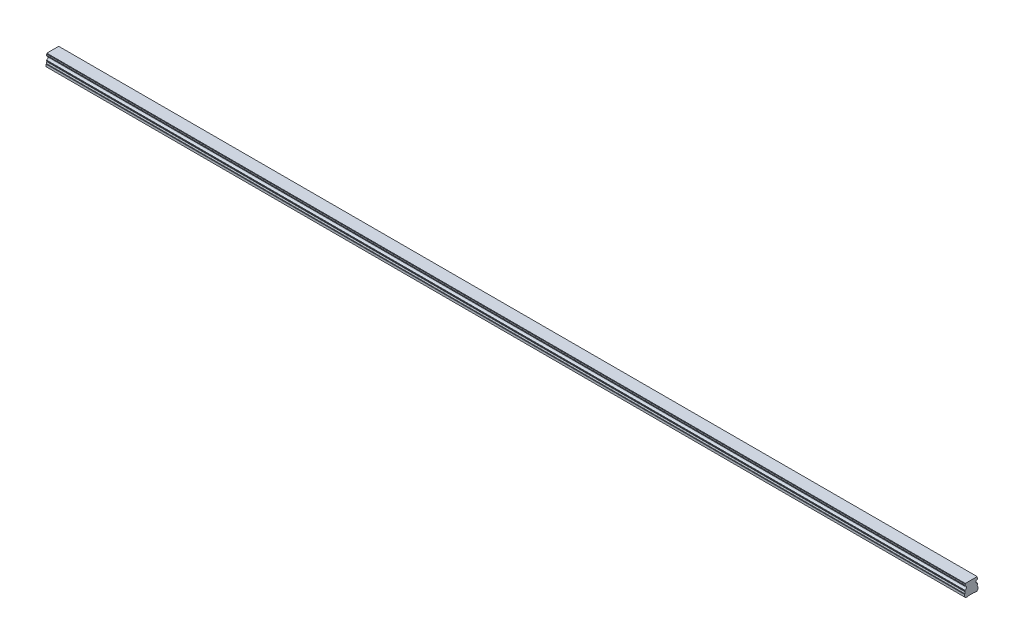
ISO-10303-21;
HEADER;
FILE_DESCRIPTION(('STEP AP214'),'2;1');
FILE_NAME('part.step','',(''),(''),'','','');
FILE_SCHEMA(('AUTOMOTIVE_DESIGN { 1 0 10303 214 1 1 1 1 }'));
ENDSEC;
DATA;
#1=APPLICATION_CONTEXT('core data for automotive mechanical design processes');
#2=APPLICATION_PROTOCOL_DEFINITION('international standard','automotive_design',2000,#1);
#3=PRODUCT_CONTEXT('',#1,'mechanical');
#4=PRODUCT('Part','Part','',(#3));
#5=PRODUCT_RELATED_PRODUCT_CATEGORY('part','',(#4));
#6=PRODUCT_DEFINITION_FORMATION('','',#4);
#7=PRODUCT_DEFINITION_CONTEXT('part definition',#1,'design');
#8=PRODUCT_DEFINITION('design','',#6,#7);
#9=PRODUCT_DEFINITION_SHAPE('','',#8);
#10=(LENGTH_UNIT() NAMED_UNIT(*) SI_UNIT(.MILLI.,.METRE.));
#11=(NAMED_UNIT(*) PLANE_ANGLE_UNIT() SI_UNIT($,.RADIAN.));
#12=(NAMED_UNIT(*) SI_UNIT($,.STERADIAN.) SOLID_ANGLE_UNIT());
#13=UNCERTAINTY_MEASURE_WITH_UNIT(LENGTH_MEASURE(1.E-05),#10,'distance_accuracy_value','');
#14=(GEOMETRIC_REPRESENTATION_CONTEXT(3) GLOBAL_UNCERTAINTY_ASSIGNED_CONTEXT((#13)) GLOBAL_UNIT_ASSIGNED_CONTEXT((#10,
#11,#12)) REPRESENTATION_CONTEXT('',''));
#15=CARTESIAN_POINT('',(0.,0.,0.));
#16=DIRECTION('',(0.,0.,1.));
#17=DIRECTION('',(1.,0.,0.));
#18=AXIS2_PLACEMENT_3D('',#15,#16,#17);
#19=CARTESIAN_POINT('',(990.,0.399999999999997,0.));
#20=DIRECTION('',(0.,-1.,0.));
#21=DIRECTION('',(0.,0.,-1.));
#22=AXIS2_PLACEMENT_3D('',#19,#20,#21);
#23=CONICAL_SURFACE('',#22,2.90000000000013,0.785398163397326);
#24=CARTESIAN_POINT('',(990.,0.80000000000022,0.));
#25=DIRECTION('',(0.,1.,0.));
#26=DIRECTION('',(0.,0.,1.));
#27=AXIS2_PLACEMENT_3D('',#24,#25,#26);
#28=CIRCLE('',#27,2.5);
#29=CARTESIAN_POINT('',(990.,0.800000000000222,2.5));
#30=VERTEX_POINT('',#29);
#31=EDGE_CURVE('E11',#30,#30,#28,.F.);
#32=ORIENTED_EDGE('',*,*,#31,.F.);
#33=EDGE_LOOP('',(#32));
#34=FACE_BOUND('',#33,.T.);
#35=CARTESIAN_POINT('',(990.,0.399999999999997,0.));
#36=DIRECTION('',(0.,1.,0.));
#37=DIRECTION('',(0.,0.,1.));
#38=AXIS2_PLACEMENT_3D('',#35,#36,#37);
#39=CIRCLE('',#38,2.90000000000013);
#40=CARTESIAN_POINT('',(990.,0.399999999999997,2.90000000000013));
#41=VERTEX_POINT('',#40);
#42=EDGE_CURVE('E601',#41,#41,#39,.T.);
#43=ORIENTED_EDGE('',*,*,#42,.F.);
#44=EDGE_LOOP('',(#43));
#45=FACE_BOUND('',#44,.T.);
#46=ADVANCED_FACE('F39',(#34,#45),#23,.F.);
#47=CARTESIAN_POINT('',(990.,7.,0.));
#48=DIRECTION('',(0.,-1.,0.));
#49=DIRECTION('',(0.,0.,-1.));
#50=AXIS2_PLACEMENT_3D('',#47,#48,#49);
#51=CYLINDRICAL_SURFACE('',#50,2.5);
#52=ORIENTED_EDGE('',*,*,#31,.T.);
#53=EDGE_LOOP('',(#52));
#54=FACE_BOUND('',#53,.T.);
#55=CARTESIAN_POINT('',(990.,7.,0.));
#56=DIRECTION('',(0.,-1.,0.));
#57=DIRECTION('',(0.,0.,-1.));
#58=AXIS2_PLACEMENT_3D('',#55,#56,#57);
#59=CIRCLE('',#58,2.5);
#60=CARTESIAN_POINT('',(990.,7.,-2.50000000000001));
#61=VERTEX_POINT('',#60);
#62=EDGE_CURVE('E49',#61,#61,#59,.T.);
#63=ORIENTED_EDGE('',*,*,#62,.F.);
#64=EDGE_LOOP('',(#63));
#65=FACE_BOUND('',#64,.T.);
#66=ADVANCED_FACE('F833',(#54,#65),#51,.F.);
#67=CARTESIAN_POINT('',(990.,7.,0.));
#68=DIRECTION('',(0.,-1.,0.));
#69=DIRECTION('',(0.,0.,-1.));
#70=AXIS2_PLACEMENT_3D('',#67,#68,#69);
#71=PLANE('',#70);
#72=CARTESIAN_POINT('',(990.,7.,0.));
#73=DIRECTION('',(0.,-1.,0.));
#74=DIRECTION('',(0.,0.,-1.));
#75=AXIS2_PLACEMENT_3D('',#72,#73,#74);
#76=CIRCLE('',#75,2.1);
#77=CARTESIAN_POINT('',(990.,7.,-2.1));
#78=VERTEX_POINT('',#77);
#79=EDGE_CURVE('E42',#78,#78,#76,.T.);
#80=ORIENTED_EDGE('',*,*,#79,.F.);
#81=EDGE_LOOP('',(#80));
#82=FACE_BOUND('',#81,.T.);
#83=ORIENTED_EDGE('',*,*,#62,.T.);
#84=EDGE_LOOP('',(#83));
#85=FACE_BOUND('',#84,.T.);
#86=ADVANCED_FACE('F838',(#82,#85),#71,.T.);
#87=CARTESIAN_POINT('',(930.,0.399999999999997,0.));
#88=DIRECTION('',(0.,-1.,0.));
#89=DIRECTION('',(0.,0.,-1.));
#90=AXIS2_PLACEMENT_3D('',#87,#88,#89);
#91=CONICAL_SURFACE('',#90,2.90000000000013,0.785398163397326);
#92=CARTESIAN_POINT('',(930.,0.80000000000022,0.));
#93=DIRECTION('',(0.,1.,0.));
#94=DIRECTION('',(0.,0.,1.));
#95=AXIS2_PLACEMENT_3D('',#92,#93,#94);
#96=CIRCLE('',#95,2.5);
#97=CARTESIAN_POINT('',(930.,0.800000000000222,2.5));
#98=VERTEX_POINT('',#97);
#99=EDGE_CURVE('E597',#98,#98,#96,.F.);
#100=ORIENTED_EDGE('',*,*,#99,.F.);
#101=EDGE_LOOP('',(#100));
#102=FACE_BOUND('',#101,.T.);
#103=CARTESIAN_POINT('',(930.,0.399999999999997,0.));
#104=DIRECTION('',(0.,1.,0.));
#105=DIRECTION('',(0.,0.,1.));
#106=AXIS2_PLACEMENT_3D('',#103,#104,#105);
#107=CIRCLE('',#106,2.90000000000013);
#108=CARTESIAN_POINT('',(930.,0.399999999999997,2.90000000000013));
#109=VERTEX_POINT('',#108);
#110=EDGE_CURVE('E589',#109,#109,#107,.T.);
#111=ORIENTED_EDGE('',*,*,#110,.F.);
#112=EDGE_LOOP('',(#111));
#113=FACE_BOUND('',#112,.T.);
#114=ADVANCED_FACE('F1081',(#102,#113),#91,.F.);
#115=CARTESIAN_POINT('',(930.,7.,0.));
#116=DIRECTION('',(0.,-1.,0.));
#117=DIRECTION('',(0.,0.,-1.));
#118=AXIS2_PLACEMENT_3D('',#115,#116,#117);
#119=CYLINDRICAL_SURFACE('',#118,2.5);
#120=ORIENTED_EDGE('',*,*,#99,.T.);
#121=EDGE_LOOP('',(#120));
#122=FACE_BOUND('',#121,.T.);
#123=CARTESIAN_POINT('',(930.,7.,0.));
#124=DIRECTION('',(0.,-1.,0.));
#125=DIRECTION('',(0.,0.,-1.));
#126=AXIS2_PLACEMENT_3D('',#123,#124,#125);
#127=CIRCLE('',#126,2.5);
#128=CARTESIAN_POINT('',(930.,7.,-2.50000000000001));
#129=VERTEX_POINT('',#128);
#130=EDGE_CURVE('E593',#129,#129,#127,.T.);
#131=ORIENTED_EDGE('',*,*,#130,.F.);
#132=EDGE_LOOP('',(#131));
#133=FACE_BOUND('',#132,.T.);
#134=ADVANCED_FACE('F1077',(#122,#133),#119,.F.);
#135=CARTESIAN_POINT('',(930.,7.,0.));
#136=DIRECTION('',(0.,-1.,0.));
#137=DIRECTION('',(0.,0.,-1.));
#138=AXIS2_PLACEMENT_3D('',#135,#136,#137);
#139=PLANE('',#138);
#140=CARTESIAN_POINT('',(930.,7.,0.));
#141=DIRECTION('',(0.,-1.,0.));
#142=DIRECTION('',(0.,0.,-1.));
#143=AXIS2_PLACEMENT_3D('',#140,#141,#142);
#144=CIRCLE('',#143,2.1);
#145=CARTESIAN_POINT('',(930.,7.,-2.1));
#146=VERTEX_POINT('',#145);
#147=EDGE_CURVE('E664',#146,#146,#144,.T.);
#148=ORIENTED_EDGE('',*,*,#147,.F.);
#149=EDGE_LOOP('',(#148));
#150=FACE_BOUND('',#149,.T.);
#151=ORIENTED_EDGE('',*,*,#130,.T.);
#152=EDGE_LOOP('',(#151));
#153=FACE_BOUND('',#152,.T.);
#154=ADVANCED_FACE('F1073',(#150,#153),#139,.T.);
#155=CARTESIAN_POINT('',(870.,0.399999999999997,0.));
#156=DIRECTION('',(0.,-1.,0.));
#157=DIRECTION('',(0.,0.,-1.));
#158=AXIS2_PLACEMENT_3D('',#155,#156,#157);
#159=CONICAL_SURFACE('',#158,2.90000000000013,0.785398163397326);
#160=CARTESIAN_POINT('',(870.,0.80000000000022,0.));
#161=DIRECTION('',(0.,1.,0.));
#162=DIRECTION('',(0.,0.,1.));
#163=AXIS2_PLACEMENT_3D('',#160,#161,#162);
#164=CIRCLE('',#163,2.5);
#165=CARTESIAN_POINT('',(870.,0.800000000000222,2.5));
#166=VERTEX_POINT('',#165);
#167=EDGE_CURVE('E585',#166,#166,#164,.F.);
#168=ORIENTED_EDGE('',*,*,#167,.F.);
#169=EDGE_LOOP('',(#168));
#170=FACE_BOUND('',#169,.T.);
#171=CARTESIAN_POINT('',(870.,0.399999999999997,0.));
#172=DIRECTION('',(0.,1.,0.));
#173=DIRECTION('',(0.,0.,1.));
#174=AXIS2_PLACEMENT_3D('',#171,#172,#173);
#175=CIRCLE('',#174,2.90000000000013);
#176=CARTESIAN_POINT('',(870.,0.399999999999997,2.90000000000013));
#177=VERTEX_POINT('',#176);
#178=EDGE_CURVE('E577',#177,#177,#175,.T.);
#179=ORIENTED_EDGE('',*,*,#178,.F.);
#180=EDGE_LOOP('',(#179));
#181=FACE_BOUND('',#180,.T.);
#182=ADVANCED_FACE('F1069',(#170,#181),#159,.F.);
#183=CARTESIAN_POINT('',(870.,7.,0.));
#184=DIRECTION('',(0.,-1.,0.));
#185=DIRECTION('',(0.,0.,-1.));
#186=AXIS2_PLACEMENT_3D('',#183,#184,#185);
#187=CYLINDRICAL_SURFACE('',#186,2.5);
#188=ORIENTED_EDGE('',*,*,#167,.T.);
#189=EDGE_LOOP('',(#188));
#190=FACE_BOUND('',#189,.T.);
#191=CARTESIAN_POINT('',(870.,7.,0.));
#192=DIRECTION('',(0.,-1.,0.));
#193=DIRECTION('',(0.,0.,-1.));
#194=AXIS2_PLACEMENT_3D('',#191,#192,#193);
#195=CIRCLE('',#194,2.5);
#196=CARTESIAN_POINT('',(870.,7.,-2.50000000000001));
#197=VERTEX_POINT('',#196);
#198=EDGE_CURVE('E581',#197,#197,#195,.T.);
#199=ORIENTED_EDGE('',*,*,#198,.F.);
#200=EDGE_LOOP('',(#199));
#201=FACE_BOUND('',#200,.T.);
#202=ADVANCED_FACE('F1065',(#190,#201),#187,.F.);
#203=CARTESIAN_POINT('',(870.,7.,0.));
#204=DIRECTION('',(0.,-1.,0.));
#205=DIRECTION('',(0.,0.,-1.));
#206=AXIS2_PLACEMENT_3D('',#203,#204,#205);
#207=PLANE('',#206);
#208=CARTESIAN_POINT('',(870.,7.,0.));
#209=DIRECTION('',(0.,-1.,0.));
#210=DIRECTION('',(0.,0.,-1.));
#211=AXIS2_PLACEMENT_3D('',#208,#209,#210);
#212=CIRCLE('',#211,2.1);
#213=CARTESIAN_POINT('',(870.,7.,-2.1));
#214=VERTEX_POINT('',#213);
#215=EDGE_CURVE('E661',#214,#214,#212,.T.);
#216=ORIENTED_EDGE('',*,*,#215,.F.);
#217=EDGE_LOOP('',(#216));
#218=FACE_BOUND('',#217,.T.);
#219=ORIENTED_EDGE('',*,*,#198,.T.);
#220=EDGE_LOOP('',(#219));
#221=FACE_BOUND('',#220,.T.);
#222=ADVANCED_FACE('F1061',(#218,#221),#207,.T.);
#223=CARTESIAN_POINT('',(810.,0.399999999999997,0.));
#224=DIRECTION('',(0.,-1.,0.));
#225=DIRECTION('',(0.,0.,-1.));
#226=AXIS2_PLACEMENT_3D('',#223,#224,#225);
#227=CONICAL_SURFACE('',#226,2.90000000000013,0.785398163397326);
#228=CARTESIAN_POINT('',(810.,0.80000000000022,0.));
#229=DIRECTION('',(0.,1.,0.));
#230=DIRECTION('',(0.,0.,1.));
#231=AXIS2_PLACEMENT_3D('',#228,#229,#230);
#232=CIRCLE('',#231,2.5);
#233=CARTESIAN_POINT('',(810.,0.800000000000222,2.5));
#234=VERTEX_POINT('',#233);
#235=EDGE_CURVE('E573',#234,#234,#232,.F.);
#236=ORIENTED_EDGE('',*,*,#235,.F.);
#237=EDGE_LOOP('',(#236));
#238=FACE_BOUND('',#237,.T.);
#239=CARTESIAN_POINT('',(810.,0.399999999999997,0.));
#240=DIRECTION('',(0.,1.,0.));
#241=DIRECTION('',(0.,0.,1.));
#242=AXIS2_PLACEMENT_3D('',#239,#240,#241);
#243=CIRCLE('',#242,2.90000000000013);
#244=CARTESIAN_POINT('',(810.,0.399999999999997,2.90000000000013));
#245=VERTEX_POINT('',#244);
#246=EDGE_CURVE('E565',#245,#245,#243,.T.);
#247=ORIENTED_EDGE('',*,*,#246,.F.);
#248=EDGE_LOOP('',(#247));
#249=FACE_BOUND('',#248,.T.);
#250=ADVANCED_FACE('F1057',(#238,#249),#227,.F.);
#251=CARTESIAN_POINT('',(810.,7.,0.));
#252=DIRECTION('',(0.,-1.,0.));
#253=DIRECTION('',(0.,0.,-1.));
#254=AXIS2_PLACEMENT_3D('',#251,#252,#253);
#255=CYLINDRICAL_SURFACE('',#254,2.5);
#256=ORIENTED_EDGE('',*,*,#235,.T.);
#257=EDGE_LOOP('',(#256));
#258=FACE_BOUND('',#257,.T.);
#259=CARTESIAN_POINT('',(810.,7.,0.));
#260=DIRECTION('',(0.,-1.,0.));
#261=DIRECTION('',(0.,0.,-1.));
#262=AXIS2_PLACEMENT_3D('',#259,#260,#261);
#263=CIRCLE('',#262,2.5);
#264=CARTESIAN_POINT('',(810.,7.,-2.50000000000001));
#265=VERTEX_POINT('',#264);
#266=EDGE_CURVE('E569',#265,#265,#263,.T.);
#267=ORIENTED_EDGE('',*,*,#266,.F.);
#268=EDGE_LOOP('',(#267));
#269=FACE_BOUND('',#268,.T.);
#270=ADVANCED_FACE('F1053',(#258,#269),#255,.F.);
#271=CARTESIAN_POINT('',(810.,7.,0.));
#272=DIRECTION('',(0.,-1.,0.));
#273=DIRECTION('',(0.,0.,-1.));
#274=AXIS2_PLACEMENT_3D('',#271,#272,#273);
#275=PLANE('',#274);
#276=CARTESIAN_POINT('',(810.,7.,0.));
#277=DIRECTION('',(0.,-1.,0.));
#278=DIRECTION('',(0.,0.,-1.));
#279=AXIS2_PLACEMENT_3D('',#276,#277,#278);
#280=CIRCLE('',#279,2.1);
#281=CARTESIAN_POINT('',(810.,7.,-2.1));
#282=VERTEX_POINT('',#281);
#283=EDGE_CURVE('E657',#282,#282,#280,.T.);
#284=ORIENTED_EDGE('',*,*,#283,.F.);
#285=EDGE_LOOP('',(#284));
#286=FACE_BOUND('',#285,.T.);
#287=ORIENTED_EDGE('',*,*,#266,.T.);
#288=EDGE_LOOP('',(#287));
#289=FACE_BOUND('',#288,.T.);
#290=ADVANCED_FACE('F1049',(#286,#289),#275,.T.);
#291=CARTESIAN_POINT('',(750.,0.399999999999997,0.));
#292=DIRECTION('',(0.,-1.,0.));
#293=DIRECTION('',(0.,0.,-1.));
#294=AXIS2_PLACEMENT_3D('',#291,#292,#293);
#295=CONICAL_SURFACE('',#294,2.90000000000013,0.785398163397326);
#296=CARTESIAN_POINT('',(750.,0.80000000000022,0.));
#297=DIRECTION('',(0.,1.,0.));
#298=DIRECTION('',(0.,0.,1.));
#299=AXIS2_PLACEMENT_3D('',#296,#297,#298);
#300=CIRCLE('',#299,2.5);
#301=CARTESIAN_POINT('',(750.,0.800000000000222,2.5));
#302=VERTEX_POINT('',#301);
#303=EDGE_CURVE('E561',#302,#302,#300,.F.);
#304=ORIENTED_EDGE('',*,*,#303,.F.);
#305=EDGE_LOOP('',(#304));
#306=FACE_BOUND('',#305,.T.);
#307=CARTESIAN_POINT('',(750.,0.399999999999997,0.));
#308=DIRECTION('',(0.,1.,0.));
#309=DIRECTION('',(0.,0.,1.));
#310=AXIS2_PLACEMENT_3D('',#307,#308,#309);
#311=CIRCLE('',#310,2.90000000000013);
#312=CARTESIAN_POINT('',(750.,0.399999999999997,2.90000000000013));
#313=VERTEX_POINT('',#312);
#314=EDGE_CURVE('E553',#313,#313,#311,.T.);
#315=ORIENTED_EDGE('',*,*,#314,.F.);
#316=EDGE_LOOP('',(#315));
#317=FACE_BOUND('',#316,.T.);
#318=ADVANCED_FACE('F1045',(#306,#317),#295,.F.);
#319=CARTESIAN_POINT('',(750.,7.,0.));
#320=DIRECTION('',(0.,-1.,0.));
#321=DIRECTION('',(0.,0.,-1.));
#322=AXIS2_PLACEMENT_3D('',#319,#320,#321);
#323=CYLINDRICAL_SURFACE('',#322,2.5);
#324=ORIENTED_EDGE('',*,*,#303,.T.);
#325=EDGE_LOOP('',(#324));
#326=FACE_BOUND('',#325,.T.);
#327=CARTESIAN_POINT('',(750.,7.,0.));
#328=DIRECTION('',(0.,-1.,0.));
#329=DIRECTION('',(0.,0.,-1.));
#330=AXIS2_PLACEMENT_3D('',#327,#328,#329);
#331=CIRCLE('',#330,2.5);
#332=CARTESIAN_POINT('',(750.,7.,-2.50000000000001));
#333=VERTEX_POINT('',#332);
#334=EDGE_CURVE('E557',#333,#333,#331,.T.);
#335=ORIENTED_EDGE('',*,*,#334,.F.);
#336=EDGE_LOOP('',(#335));
#337=FACE_BOUND('',#336,.T.);
#338=ADVANCED_FACE('F1041',(#326,#337),#323,.F.);
#339=CARTESIAN_POINT('',(750.,7.,0.));
#340=DIRECTION('',(0.,-1.,0.));
#341=DIRECTION('',(0.,0.,-1.));
#342=AXIS2_PLACEMENT_3D('',#339,#340,#341);
#343=PLANE('',#342);
#344=CARTESIAN_POINT('',(750.,7.,0.));
#345=DIRECTION('',(0.,-1.,0.));
#346=DIRECTION('',(0.,0.,-1.));
#347=AXIS2_PLACEMENT_3D('',#344,#345,#346);
#348=CIRCLE('',#347,2.1);
#349=CARTESIAN_POINT('',(750.,7.,-2.1));
#350=VERTEX_POINT('',#349);
#351=EDGE_CURVE('E653',#350,#350,#348,.T.);
#352=ORIENTED_EDGE('',*,*,#351,.F.);
#353=EDGE_LOOP('',(#352));
#354=FACE_BOUND('',#353,.T.);
#355=ORIENTED_EDGE('',*,*,#334,.T.);
#356=EDGE_LOOP('',(#355));
#357=FACE_BOUND('',#356,.T.);
#358=ADVANCED_FACE('F1037',(#354,#357),#343,.T.);
#359=CARTESIAN_POINT('',(690.,0.399999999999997,0.));
#360=DIRECTION('',(0.,-1.,0.));
#361=DIRECTION('',(0.,0.,-1.));
#362=AXIS2_PLACEMENT_3D('',#359,#360,#361);
#363=CONICAL_SURFACE('',#362,2.90000000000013,0.785398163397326);
#364=CARTESIAN_POINT('',(690.,0.80000000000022,0.));
#365=DIRECTION('',(0.,1.,0.));
#366=DIRECTION('',(0.,0.,1.));
#367=AXIS2_PLACEMENT_3D('',#364,#365,#366);
#368=CIRCLE('',#367,2.5);
#369=CARTESIAN_POINT('',(690.,0.800000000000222,2.5));
#370=VERTEX_POINT('',#369);
#371=EDGE_CURVE('E549',#370,#370,#368,.F.);
#372=ORIENTED_EDGE('',*,*,#371,.F.);
#373=EDGE_LOOP('',(#372));
#374=FACE_BOUND('',#373,.T.);
#375=CARTESIAN_POINT('',(690.,0.399999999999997,0.));
#376=DIRECTION('',(0.,1.,0.));
#377=DIRECTION('',(0.,0.,1.));
#378=AXIS2_PLACEMENT_3D('',#375,#376,#377);
#379=CIRCLE('',#378,2.90000000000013);
#380=CARTESIAN_POINT('',(690.,0.399999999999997,2.90000000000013));
#381=VERTEX_POINT('',#380);
#382=EDGE_CURVE('E541',#381,#381,#379,.T.);
#383=ORIENTED_EDGE('',*,*,#382,.F.);
#384=EDGE_LOOP('',(#383));
#385=FACE_BOUND('',#384,.T.);
#386=ADVANCED_FACE('F1033',(#374,#385),#363,.F.);
#387=CARTESIAN_POINT('',(690.,7.,0.));
#388=DIRECTION('',(0.,-1.,0.));
#389=DIRECTION('',(0.,0.,-1.));
#390=AXIS2_PLACEMENT_3D('',#387,#388,#389);
#391=CYLINDRICAL_SURFACE('',#390,2.5);
#392=ORIENTED_EDGE('',*,*,#371,.T.);
#393=EDGE_LOOP('',(#392));
#394=FACE_BOUND('',#393,.T.);
#395=CARTESIAN_POINT('',(690.,7.,0.));
#396=DIRECTION('',(0.,-1.,0.));
#397=DIRECTION('',(0.,0.,-1.));
#398=AXIS2_PLACEMENT_3D('',#395,#396,#397);
#399=CIRCLE('',#398,2.5);
#400=CARTESIAN_POINT('',(690.,7.,-2.50000000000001));
#401=VERTEX_POINT('',#400);
#402=EDGE_CURVE('E545',#401,#401,#399,.T.);
#403=ORIENTED_EDGE('',*,*,#402,.F.);
#404=EDGE_LOOP('',(#403));
#405=FACE_BOUND('',#404,.T.);
#406=ADVANCED_FACE('F1029',(#394,#405),#391,.F.);
#407=CARTESIAN_POINT('',(690.,7.,0.));
#408=DIRECTION('',(0.,-1.,0.));
#409=DIRECTION('',(0.,0.,-1.));
#410=AXIS2_PLACEMENT_3D('',#407,#408,#409);
#411=PLANE('',#410);
#412=CARTESIAN_POINT('',(690.,7.,0.));
#413=DIRECTION('',(0.,-1.,0.));
#414=DIRECTION('',(0.,0.,-1.));
#415=AXIS2_PLACEMENT_3D('',#412,#413,#414);
#416=CIRCLE('',#415,2.1);
#417=CARTESIAN_POINT('',(690.,7.,-2.1));
#418=VERTEX_POINT('',#417);
#419=EDGE_CURVE('E649',#418,#418,#416,.T.);
#420=ORIENTED_EDGE('',*,*,#419,.F.);
#421=EDGE_LOOP('',(#420));
#422=FACE_BOUND('',#421,.T.);
#423=ORIENTED_EDGE('',*,*,#402,.T.);
#424=EDGE_LOOP('',(#423));
#425=FACE_BOUND('',#424,.T.);
#426=ADVANCED_FACE('F1025',(#422,#425),#411,.T.);
#427=CARTESIAN_POINT('',(630.,0.399999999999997,0.));
#428=DIRECTION('',(0.,-1.,0.));
#429=DIRECTION('',(0.,0.,-1.));
#430=AXIS2_PLACEMENT_3D('',#427,#428,#429);
#431=CONICAL_SURFACE('',#430,2.90000000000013,0.785398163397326);
#432=CARTESIAN_POINT('',(630.,0.80000000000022,0.));
#433=DIRECTION('',(0.,1.,0.));
#434=DIRECTION('',(0.,0.,1.));
#435=AXIS2_PLACEMENT_3D('',#432,#433,#434);
#436=CIRCLE('',#435,2.5);
#437=CARTESIAN_POINT('',(630.,0.800000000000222,2.5));
#438=VERTEX_POINT('',#437);
#439=EDGE_CURVE('E537',#438,#438,#436,.F.);
#440=ORIENTED_EDGE('',*,*,#439,.F.);
#441=EDGE_LOOP('',(#440));
#442=FACE_BOUND('',#441,.T.);
#443=CARTESIAN_POINT('',(630.,0.399999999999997,0.));
#444=DIRECTION('',(0.,1.,0.));
#445=DIRECTION('',(0.,0.,1.));
#446=AXIS2_PLACEMENT_3D('',#443,#444,#445);
#447=CIRCLE('',#446,2.90000000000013);
#448=CARTESIAN_POINT('',(630.,0.399999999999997,2.90000000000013));
#449=VERTEX_POINT('',#448);
#450=EDGE_CURVE('E529',#449,#449,#447,.T.);
#451=ORIENTED_EDGE('',*,*,#450,.F.);
#452=EDGE_LOOP('',(#451));
#453=FACE_BOUND('',#452,.T.);
#454=ADVANCED_FACE('F1021',(#442,#453),#431,.F.);
#455=CARTESIAN_POINT('',(630.,7.,0.));
#456=DIRECTION('',(0.,-1.,0.));
#457=DIRECTION('',(0.,0.,-1.));
#458=AXIS2_PLACEMENT_3D('',#455,#456,#457);
#459=CYLINDRICAL_SURFACE('',#458,2.5);
#460=ORIENTED_EDGE('',*,*,#439,.T.);
#461=EDGE_LOOP('',(#460));
#462=FACE_BOUND('',#461,.T.);
#463=CARTESIAN_POINT('',(630.,7.,0.));
#464=DIRECTION('',(0.,-1.,0.));
#465=DIRECTION('',(0.,0.,-1.));
#466=AXIS2_PLACEMENT_3D('',#463,#464,#465);
#467=CIRCLE('',#466,2.5);
#468=CARTESIAN_POINT('',(630.,7.,-2.50000000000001));
#469=VERTEX_POINT('',#468);
#470=EDGE_CURVE('E533',#469,#469,#467,.T.);
#471=ORIENTED_EDGE('',*,*,#470,.F.);
#472=EDGE_LOOP('',(#471));
#473=FACE_BOUND('',#472,.T.);
#474=ADVANCED_FACE('F1017',(#462,#473),#459,.F.);
#475=CARTESIAN_POINT('',(630.,7.,0.));
#476=DIRECTION('',(0.,-1.,0.));
#477=DIRECTION('',(0.,0.,-1.));
#478=AXIS2_PLACEMENT_3D('',#475,#476,#477);
#479=PLANE('',#478);
#480=CARTESIAN_POINT('',(630.,7.,0.));
#481=DIRECTION('',(0.,-1.,0.));
#482=DIRECTION('',(0.,0.,-1.));
#483=AXIS2_PLACEMENT_3D('',#480,#481,#482);
#484=CIRCLE('',#483,2.1);
#485=CARTESIAN_POINT('',(630.,7.,-2.1));
#486=VERTEX_POINT('',#485);
#487=EDGE_CURVE('E645',#486,#486,#484,.T.);
#488=ORIENTED_EDGE('',*,*,#487,.F.);
#489=EDGE_LOOP('',(#488));
#490=FACE_BOUND('',#489,.T.);
#491=ORIENTED_EDGE('',*,*,#470,.T.);
#492=EDGE_LOOP('',(#491));
#493=FACE_BOUND('',#492,.T.);
#494=ADVANCED_FACE('F1013',(#490,#493),#479,.T.);
#495=CARTESIAN_POINT('',(570.,0.399999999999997,0.));
#496=DIRECTION('',(0.,-1.,0.));
#497=DIRECTION('',(0.,0.,-1.));
#498=AXIS2_PLACEMENT_3D('',#495,#496,#497);
#499=CONICAL_SURFACE('',#498,2.90000000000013,0.785398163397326);
#500=CARTESIAN_POINT('',(570.,0.80000000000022,0.));
#501=DIRECTION('',(0.,1.,0.));
#502=DIRECTION('',(0.,0.,1.));
#503=AXIS2_PLACEMENT_3D('',#500,#501,#502);
#504=CIRCLE('',#503,2.5);
#505=CARTESIAN_POINT('',(570.,0.800000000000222,2.5));
#506=VERTEX_POINT('',#505);
#507=EDGE_CURVE('E525',#506,#506,#504,.F.);
#508=ORIENTED_EDGE('',*,*,#507,.F.);
#509=EDGE_LOOP('',(#508));
#510=FACE_BOUND('',#509,.T.);
#511=CARTESIAN_POINT('',(570.,0.399999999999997,0.));
#512=DIRECTION('',(0.,1.,0.));
#513=DIRECTION('',(0.,0.,1.));
#514=AXIS2_PLACEMENT_3D('',#511,#512,#513);
#515=CIRCLE('',#514,2.90000000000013);
#516=CARTESIAN_POINT('',(570.,0.399999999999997,2.90000000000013));
#517=VERTEX_POINT('',#516);
#518=EDGE_CURVE('E517',#517,#517,#515,.T.);
#519=ORIENTED_EDGE('',*,*,#518,.F.);
#520=EDGE_LOOP('',(#519));
#521=FACE_BOUND('',#520,.T.);
#522=ADVANCED_FACE('F1009',(#510,#521),#499,.F.);
#523=CARTESIAN_POINT('',(570.,7.,0.));
#524=DIRECTION('',(0.,-1.,0.));
#525=DIRECTION('',(0.,0.,-1.));
#526=AXIS2_PLACEMENT_3D('',#523,#524,#525);
#527=CYLINDRICAL_SURFACE('',#526,2.5);
#528=ORIENTED_EDGE('',*,*,#507,.T.);
#529=EDGE_LOOP('',(#528));
#530=FACE_BOUND('',#529,.T.);
#531=CARTESIAN_POINT('',(570.,7.,0.));
#532=DIRECTION('',(0.,-1.,0.));
#533=DIRECTION('',(0.,0.,-1.));
#534=AXIS2_PLACEMENT_3D('',#531,#532,#533);
#535=CIRCLE('',#534,2.5);
#536=CARTESIAN_POINT('',(570.,7.,-2.50000000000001));
#537=VERTEX_POINT('',#536);
#538=EDGE_CURVE('E521',#537,#537,#535,.T.);
#539=ORIENTED_EDGE('',*,*,#538,.F.);
#540=EDGE_LOOP('',(#539));
#541=FACE_BOUND('',#540,.T.);
#542=ADVANCED_FACE('F1005',(#530,#541),#527,.F.);
#543=CARTESIAN_POINT('',(570.,7.,0.));
#544=DIRECTION('',(0.,-1.,0.));
#545=DIRECTION('',(0.,0.,-1.));
#546=AXIS2_PLACEMENT_3D('',#543,#544,#545);
#547=PLANE('',#546);
#548=CARTESIAN_POINT('',(570.,7.,0.));
#549=DIRECTION('',(0.,-1.,0.));
#550=DIRECTION('',(0.,0.,-1.));
#551=AXIS2_PLACEMENT_3D('',#548,#549,#550);
#552=CIRCLE('',#551,2.1);
#553=CARTESIAN_POINT('',(570.,7.,-2.1));
#554=VERTEX_POINT('',#553);
#555=EDGE_CURVE('E641',#554,#554,#552,.T.);
#556=ORIENTED_EDGE('',*,*,#555,.F.);
#557=EDGE_LOOP('',(#556));
#558=FACE_BOUND('',#557,.T.);
#559=ORIENTED_EDGE('',*,*,#538,.T.);
#560=EDGE_LOOP('',(#559));
#561=FACE_BOUND('',#560,.T.);
#562=ADVANCED_FACE('F1001',(#558,#561),#547,.T.);
#563=CARTESIAN_POINT('',(510.,0.399999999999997,0.));
#564=DIRECTION('',(0.,-1.,0.));
#565=DIRECTION('',(0.,0.,-1.));
#566=AXIS2_PLACEMENT_3D('',#563,#564,#565);
#567=CONICAL_SURFACE('',#566,2.90000000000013,0.785398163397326);
#568=CARTESIAN_POINT('',(510.,0.80000000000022,0.));
#569=DIRECTION('',(0.,1.,0.));
#570=DIRECTION('',(0.,0.,1.));
#571=AXIS2_PLACEMENT_3D('',#568,#569,#570);
#572=CIRCLE('',#571,2.5);
#573=CARTESIAN_POINT('',(510.,0.800000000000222,2.5));
#574=VERTEX_POINT('',#573);
#575=EDGE_CURVE('E513',#574,#574,#572,.F.);
#576=ORIENTED_EDGE('',*,*,#575,.F.);
#577=EDGE_LOOP('',(#576));
#578=FACE_BOUND('',#577,.T.);
#579=CARTESIAN_POINT('',(510.,0.399999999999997,0.));
#580=DIRECTION('',(0.,1.,0.));
#581=DIRECTION('',(0.,0.,1.));
#582=AXIS2_PLACEMENT_3D('',#579,#580,#581);
#583=CIRCLE('',#582,2.90000000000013);
#584=CARTESIAN_POINT('',(510.,0.399999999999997,2.90000000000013));
#585=VERTEX_POINT('',#584);
#586=EDGE_CURVE('E505',#585,#585,#583,.T.);
#587=ORIENTED_EDGE('',*,*,#586,.F.);
#588=EDGE_LOOP('',(#587));
#589=FACE_BOUND('',#588,.T.);
#590=ADVANCED_FACE('F997',(#578,#589),#567,.F.);
#591=CARTESIAN_POINT('',(510.,7.,0.));
#592=DIRECTION('',(0.,-1.,0.));
#593=DIRECTION('',(0.,0.,-1.));
#594=AXIS2_PLACEMENT_3D('',#591,#592,#593);
#595=CYLINDRICAL_SURFACE('',#594,2.5);
#596=ORIENTED_EDGE('',*,*,#575,.T.);
#597=EDGE_LOOP('',(#596));
#598=FACE_BOUND('',#597,.T.);
#599=CARTESIAN_POINT('',(510.,7.,0.));
#600=DIRECTION('',(0.,-1.,0.));
#601=DIRECTION('',(0.,0.,-1.));
#602=AXIS2_PLACEMENT_3D('',#599,#600,#601);
#603=CIRCLE('',#602,2.5);
#604=CARTESIAN_POINT('',(510.,7.,-2.50000000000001));
#605=VERTEX_POINT('',#604);
#606=EDGE_CURVE('E509',#605,#605,#603,.T.);
#607=ORIENTED_EDGE('',*,*,#606,.F.);
#608=EDGE_LOOP('',(#607));
#609=FACE_BOUND('',#608,.T.);
#610=ADVANCED_FACE('F993',(#598,#609),#595,.F.);
#611=CARTESIAN_POINT('',(510.,7.,0.));
#612=DIRECTION('',(0.,-1.,0.));
#613=DIRECTION('',(0.,0.,-1.));
#614=AXIS2_PLACEMENT_3D('',#611,#612,#613);
#615=PLANE('',#614);
#616=CARTESIAN_POINT('',(510.,7.,0.));
#617=DIRECTION('',(0.,-1.,0.));
#618=DIRECTION('',(0.,0.,-1.));
#619=AXIS2_PLACEMENT_3D('',#616,#617,#618);
#620=CIRCLE('',#619,2.1);
#621=CARTESIAN_POINT('',(510.,7.,-2.1));
#622=VERTEX_POINT('',#621);
#623=EDGE_CURVE('E637',#622,#622,#620,.T.);
#624=ORIENTED_EDGE('',*,*,#623,.F.);
#625=EDGE_LOOP('',(#624));
#626=FACE_BOUND('',#625,.T.);
#627=ORIENTED_EDGE('',*,*,#606,.T.);
#628=EDGE_LOOP('',(#627));
#629=FACE_BOUND('',#628,.T.);
#630=ADVANCED_FACE('F989',(#626,#629),#615,.T.);
#631=CARTESIAN_POINT('',(450.,0.399999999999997,0.));
#632=DIRECTION('',(0.,-1.,0.));
#633=DIRECTION('',(0.,0.,-1.));
#634=AXIS2_PLACEMENT_3D('',#631,#632,#633);
#635=CONICAL_SURFACE('',#634,2.90000000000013,0.785398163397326);
#636=CARTESIAN_POINT('',(450.,0.80000000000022,0.));
#637=DIRECTION('',(0.,1.,0.));
#638=DIRECTION('',(0.,0.,1.));
#639=AXIS2_PLACEMENT_3D('',#636,#637,#638);
#640=CIRCLE('',#639,2.5);
#641=CARTESIAN_POINT('',(450.,0.800000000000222,2.5));
#642=VERTEX_POINT('',#641);
#643=EDGE_CURVE('E501',#642,#642,#640,.F.);
#644=ORIENTED_EDGE('',*,*,#643,.F.);
#645=EDGE_LOOP('',(#644));
#646=FACE_BOUND('',#645,.T.);
#647=CARTESIAN_POINT('',(450.,0.399999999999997,0.));
#648=DIRECTION('',(0.,1.,0.));
#649=DIRECTION('',(0.,0.,1.));
#650=AXIS2_PLACEMENT_3D('',#647,#648,#649);
#651=CIRCLE('',#650,2.90000000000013);
#652=CARTESIAN_POINT('',(450.,0.399999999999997,2.90000000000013));
#653=VERTEX_POINT('',#652);
#654=EDGE_CURVE('E493',#653,#653,#651,.T.);
#655=ORIENTED_EDGE('',*,*,#654,.F.);
#656=EDGE_LOOP('',(#655));
#657=FACE_BOUND('',#656,.T.);
#658=ADVANCED_FACE('F985',(#646,#657),#635,.F.);
#659=CARTESIAN_POINT('',(450.,7.,0.));
#660=DIRECTION('',(0.,-1.,0.));
#661=DIRECTION('',(0.,0.,-1.));
#662=AXIS2_PLACEMENT_3D('',#659,#660,#661);
#663=CYLINDRICAL_SURFACE('',#662,2.5);
#664=ORIENTED_EDGE('',*,*,#643,.T.);
#665=EDGE_LOOP('',(#664));
#666=FACE_BOUND('',#665,.T.);
#667=CARTESIAN_POINT('',(450.,7.,0.));
#668=DIRECTION('',(0.,-1.,0.));
#669=DIRECTION('',(0.,0.,-1.));
#670=AXIS2_PLACEMENT_3D('',#667,#668,#669);
#671=CIRCLE('',#670,2.5);
#672=CARTESIAN_POINT('',(450.,7.,-2.50000000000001));
#673=VERTEX_POINT('',#672);
#674=EDGE_CURVE('E497',#673,#673,#671,.T.);
#675=ORIENTED_EDGE('',*,*,#674,.F.);
#676=EDGE_LOOP('',(#675));
#677=FACE_BOUND('',#676,.T.);
#678=ADVANCED_FACE('F981',(#666,#677),#663,.F.);
#679=CARTESIAN_POINT('',(450.,7.,0.));
#680=DIRECTION('',(0.,-1.,0.));
#681=DIRECTION('',(0.,0.,-1.));
#682=AXIS2_PLACEMENT_3D('',#679,#680,#681);
#683=PLANE('',#682);
#684=CARTESIAN_POINT('',(450.,7.,0.));
#685=DIRECTION('',(0.,-1.,0.));
#686=DIRECTION('',(0.,0.,-1.));
#687=AXIS2_PLACEMENT_3D('',#684,#685,#686);
#688=CIRCLE('',#687,2.1);
#689=CARTESIAN_POINT('',(450.,7.,-2.1));
#690=VERTEX_POINT('',#689);
#691=EDGE_CURVE('E633',#690,#690,#688,.T.);
#692=ORIENTED_EDGE('',*,*,#691,.F.);
#693=EDGE_LOOP('',(#692));
#694=FACE_BOUND('',#693,.T.);
#695=ORIENTED_EDGE('',*,*,#674,.T.);
#696=EDGE_LOOP('',(#695));
#697=FACE_BOUND('',#696,.T.);
#698=ADVANCED_FACE('F977',(#694,#697),#683,.T.);
#699=CARTESIAN_POINT('',(390.,0.399999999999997,0.));
#700=DIRECTION('',(0.,-1.,0.));
#701=DIRECTION('',(0.,0.,-1.));
#702=AXIS2_PLACEMENT_3D('',#699,#700,#701);
#703=CONICAL_SURFACE('',#702,2.90000000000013,0.785398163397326);
#704=CARTESIAN_POINT('',(390.,0.80000000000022,0.));
#705=DIRECTION('',(0.,1.,0.));
#706=DIRECTION('',(0.,0.,1.));
#707=AXIS2_PLACEMENT_3D('',#704,#705,#706);
#708=CIRCLE('',#707,2.5);
#709=CARTESIAN_POINT('',(390.,0.800000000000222,2.5));
#710=VERTEX_POINT('',#709);
#711=EDGE_CURVE('E489',#710,#710,#708,.F.);
#712=ORIENTED_EDGE('',*,*,#711,.F.);
#713=EDGE_LOOP('',(#712));
#714=FACE_BOUND('',#713,.T.);
#715=CARTESIAN_POINT('',(390.,0.399999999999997,0.));
#716=DIRECTION('',(0.,1.,0.));
#717=DIRECTION('',(0.,0.,1.));
#718=AXIS2_PLACEMENT_3D('',#715,#716,#717);
#719=CIRCLE('',#718,2.90000000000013);
#720=CARTESIAN_POINT('',(390.,0.399999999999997,2.90000000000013));
#721=VERTEX_POINT('',#720);
#722=EDGE_CURVE('E481',#721,#721,#719,.T.);
#723=ORIENTED_EDGE('',*,*,#722,.F.);
#724=EDGE_LOOP('',(#723));
#725=FACE_BOUND('',#724,.T.);
#726=ADVANCED_FACE('F973',(#714,#725),#703,.F.);
#727=CARTESIAN_POINT('',(390.,7.,0.));
#728=DIRECTION('',(0.,-1.,0.));
#729=DIRECTION('',(0.,0.,-1.));
#730=AXIS2_PLACEMENT_3D('',#727,#728,#729);
#731=CYLINDRICAL_SURFACE('',#730,2.5);
#732=ORIENTED_EDGE('',*,*,#711,.T.);
#733=EDGE_LOOP('',(#732));
#734=FACE_BOUND('',#733,.T.);
#735=CARTESIAN_POINT('',(390.,7.,0.));
#736=DIRECTION('',(0.,-1.,0.));
#737=DIRECTION('',(0.,0.,-1.));
#738=AXIS2_PLACEMENT_3D('',#735,#736,#737);
#739=CIRCLE('',#738,2.5);
#740=CARTESIAN_POINT('',(390.,7.,-2.50000000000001));
#741=VERTEX_POINT('',#740);
#742=EDGE_CURVE('E485',#741,#741,#739,.T.);
#743=ORIENTED_EDGE('',*,*,#742,.F.);
#744=EDGE_LOOP('',(#743));
#745=FACE_BOUND('',#744,.T.);
#746=ADVANCED_FACE('F969',(#734,#745),#731,.F.);
#747=CARTESIAN_POINT('',(390.,7.,0.));
#748=DIRECTION('',(0.,-1.,0.));
#749=DIRECTION('',(0.,0.,-1.));
#750=AXIS2_PLACEMENT_3D('',#747,#748,#749);
#751=PLANE('',#750);
#752=CARTESIAN_POINT('',(390.,7.,0.));
#753=DIRECTION('',(0.,-1.,0.));
#754=DIRECTION('',(0.,0.,-1.));
#755=AXIS2_PLACEMENT_3D('',#752,#753,#754);
#756=CIRCLE('',#755,2.1);
#757=CARTESIAN_POINT('',(390.,7.,-2.1));
#758=VERTEX_POINT('',#757);
#759=EDGE_CURVE('E629',#758,#758,#756,.T.);
#760=ORIENTED_EDGE('',*,*,#759,.F.);
#761=EDGE_LOOP('',(#760));
#762=FACE_BOUND('',#761,.T.);
#763=ORIENTED_EDGE('',*,*,#742,.T.);
#764=EDGE_LOOP('',(#763));
#765=FACE_BOUND('',#764,.T.);
#766=ADVANCED_FACE('F965',(#762,#765),#751,.T.);
#767=CARTESIAN_POINT('',(330.,0.399999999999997,0.));
#768=DIRECTION('',(0.,-1.,0.));
#769=DIRECTION('',(0.,0.,-1.));
#770=AXIS2_PLACEMENT_3D('',#767,#768,#769);
#771=CONICAL_SURFACE('',#770,2.90000000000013,0.785398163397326);
#772=CARTESIAN_POINT('',(330.,0.80000000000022,0.));
#773=DIRECTION('',(0.,1.,0.));
#774=DIRECTION('',(0.,0.,1.));
#775=AXIS2_PLACEMENT_3D('',#772,#773,#774);
#776=CIRCLE('',#775,2.5);
#777=CARTESIAN_POINT('',(330.,0.800000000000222,2.5));
#778=VERTEX_POINT('',#777);
#779=EDGE_CURVE('E477',#778,#778,#776,.F.);
#780=ORIENTED_EDGE('',*,*,#779,.F.);
#781=EDGE_LOOP('',(#780));
#782=FACE_BOUND('',#781,.T.);
#783=CARTESIAN_POINT('',(330.,0.399999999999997,0.));
#784=DIRECTION('',(0.,1.,0.));
#785=DIRECTION('',(0.,0.,1.));
#786=AXIS2_PLACEMENT_3D('',#783,#784,#785);
#787=CIRCLE('',#786,2.90000000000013);
#788=CARTESIAN_POINT('',(330.,0.399999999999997,2.90000000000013));
#789=VERTEX_POINT('',#788);
#790=EDGE_CURVE('E469',#789,#789,#787,.T.);
#791=ORIENTED_EDGE('',*,*,#790,.F.);
#792=EDGE_LOOP('',(#791));
#793=FACE_BOUND('',#792,.T.);
#794=ADVANCED_FACE('F961',(#782,#793),#771,.F.);
#795=CARTESIAN_POINT('',(330.,7.,0.));
#796=DIRECTION('',(0.,-1.,0.));
#797=DIRECTION('',(0.,0.,-1.));
#798=AXIS2_PLACEMENT_3D('',#795,#796,#797);
#799=CYLINDRICAL_SURFACE('',#798,2.5);
#800=ORIENTED_EDGE('',*,*,#779,.T.);
#801=EDGE_LOOP('',(#800));
#802=FACE_BOUND('',#801,.T.);
#803=CARTESIAN_POINT('',(330.,7.,0.));
#804=DIRECTION('',(0.,-1.,0.));
#805=DIRECTION('',(0.,0.,-1.));
#806=AXIS2_PLACEMENT_3D('',#803,#804,#805);
#807=CIRCLE('',#806,2.5);
#808=CARTESIAN_POINT('',(330.,7.,-2.50000000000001));
#809=VERTEX_POINT('',#808);
#810=EDGE_CURVE('E473',#809,#809,#807,.T.);
#811=ORIENTED_EDGE('',*,*,#810,.F.);
#812=EDGE_LOOP('',(#811));
#813=FACE_BOUND('',#812,.T.);
#814=ADVANCED_FACE('F957',(#802,#813),#799,.F.);
#815=CARTESIAN_POINT('',(330.,7.,0.));
#816=DIRECTION('',(0.,-1.,0.));
#817=DIRECTION('',(0.,0.,-1.));
#818=AXIS2_PLACEMENT_3D('',#815,#816,#817);
#819=PLANE('',#818);
#820=CARTESIAN_POINT('',(330.,7.,0.));
#821=DIRECTION('',(0.,-1.,0.));
#822=DIRECTION('',(0.,0.,-1.));
#823=AXIS2_PLACEMENT_3D('',#820,#821,#822);
#824=CIRCLE('',#823,2.1);
#825=CARTESIAN_POINT('',(330.,7.,-2.1));
#826=VERTEX_POINT('',#825);
#827=EDGE_CURVE('E625',#826,#826,#824,.T.);
#828=ORIENTED_EDGE('',*,*,#827,.F.);
#829=EDGE_LOOP('',(#828));
#830=FACE_BOUND('',#829,.T.);
#831=ORIENTED_EDGE('',*,*,#810,.T.);
#832=EDGE_LOOP('',(#831));
#833=FACE_BOUND('',#832,.T.);
#834=ADVANCED_FACE('F953',(#830,#833),#819,.T.);
#835=CARTESIAN_POINT('',(270.,0.399999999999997,0.));
#836=DIRECTION('',(0.,-1.,0.));
#837=DIRECTION('',(0.,0.,-1.));
#838=AXIS2_PLACEMENT_3D('',#835,#836,#837);
#839=CONICAL_SURFACE('',#838,2.90000000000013,0.785398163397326);
#840=CARTESIAN_POINT('',(270.,0.80000000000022,0.));
#841=DIRECTION('',(0.,1.,0.));
#842=DIRECTION('',(0.,0.,1.));
#843=AXIS2_PLACEMENT_3D('',#840,#841,#842);
#844=CIRCLE('',#843,2.5);
#845=CARTESIAN_POINT('',(270.,0.800000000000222,2.5));
#846=VERTEX_POINT('',#845);
#847=EDGE_CURVE('E465',#846,#846,#844,.F.);
#848=ORIENTED_EDGE('',*,*,#847,.F.);
#849=EDGE_LOOP('',(#848));
#850=FACE_BOUND('',#849,.T.);
#851=CARTESIAN_POINT('',(270.,0.399999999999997,0.));
#852=DIRECTION('',(0.,1.,0.));
#853=DIRECTION('',(0.,0.,1.));
#854=AXIS2_PLACEMENT_3D('',#851,#852,#853);
#855=CIRCLE('',#854,2.90000000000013);
#856=CARTESIAN_POINT('',(270.,0.399999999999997,2.90000000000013));
#857=VERTEX_POINT('',#856);
#858=EDGE_CURVE('E457',#857,#857,#855,.T.);
#859=ORIENTED_EDGE('',*,*,#858,.F.);
#860=EDGE_LOOP('',(#859));
#861=FACE_BOUND('',#860,.T.);
#862=ADVANCED_FACE('F949',(#850,#861),#839,.F.);
#863=CARTESIAN_POINT('',(270.,7.,0.));
#864=DIRECTION('',(0.,-1.,0.));
#865=DIRECTION('',(0.,0.,-1.));
#866=AXIS2_PLACEMENT_3D('',#863,#864,#865);
#867=CYLINDRICAL_SURFACE('',#866,2.5);
#868=ORIENTED_EDGE('',*,*,#847,.T.);
#869=EDGE_LOOP('',(#868));
#870=FACE_BOUND('',#869,.T.);
#871=CARTESIAN_POINT('',(270.,7.,0.));
#872=DIRECTION('',(0.,-1.,0.));
#873=DIRECTION('',(0.,0.,-1.));
#874=AXIS2_PLACEMENT_3D('',#871,#872,#873);
#875=CIRCLE('',#874,2.5);
#876=CARTESIAN_POINT('',(270.,7.,-2.50000000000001));
#877=VERTEX_POINT('',#876);
#878=EDGE_CURVE('E461',#877,#877,#875,.T.);
#879=ORIENTED_EDGE('',*,*,#878,.F.);
#880=EDGE_LOOP('',(#879));
#881=FACE_BOUND('',#880,.T.);
#882=ADVANCED_FACE('F945',(#870,#881),#867,.F.);
#883=CARTESIAN_POINT('',(270.,7.,0.));
#884=DIRECTION('',(0.,-1.,0.));
#885=DIRECTION('',(0.,0.,-1.));
#886=AXIS2_PLACEMENT_3D('',#883,#884,#885);
#887=PLANE('',#886);
#888=CARTESIAN_POINT('',(270.,7.,0.));
#889=DIRECTION('',(0.,-1.,0.));
#890=DIRECTION('',(0.,0.,-1.));
#891=AXIS2_PLACEMENT_3D('',#888,#889,#890);
#892=CIRCLE('',#891,2.1);
#893=CARTESIAN_POINT('',(270.,7.,-2.1));
#894=VERTEX_POINT('',#893);
#895=EDGE_CURVE('E621',#894,#894,#892,.T.);
#896=ORIENTED_EDGE('',*,*,#895,.F.);
#897=EDGE_LOOP('',(#896));
#898=FACE_BOUND('',#897,.T.);
#899=ORIENTED_EDGE('',*,*,#878,.T.);
#900=EDGE_LOOP('',(#899));
#901=FACE_BOUND('',#900,.T.);
#902=ADVANCED_FACE('F941',(#898,#901),#887,.T.);
#903=CARTESIAN_POINT('',(210.,0.399999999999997,0.));
#904=DIRECTION('',(0.,-1.,0.));
#905=DIRECTION('',(0.,0.,-1.));
#906=AXIS2_PLACEMENT_3D('',#903,#904,#905);
#907=CONICAL_SURFACE('',#906,2.90000000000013,0.785398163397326);
#908=CARTESIAN_POINT('',(210.,0.80000000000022,0.));
#909=DIRECTION('',(0.,1.,0.));
#910=DIRECTION('',(0.,0.,1.));
#911=AXIS2_PLACEMENT_3D('',#908,#909,#910);
#912=CIRCLE('',#911,2.5);
#913=CARTESIAN_POINT('',(210.,0.800000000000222,2.5));
#914=VERTEX_POINT('',#913);
#915=EDGE_CURVE('E453',#914,#914,#912,.F.);
#916=ORIENTED_EDGE('',*,*,#915,.F.);
#917=EDGE_LOOP('',(#916));
#918=FACE_BOUND('',#917,.T.);
#919=CARTESIAN_POINT('',(210.,0.399999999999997,0.));
#920=DIRECTION('',(0.,1.,0.));
#921=DIRECTION('',(0.,0.,1.));
#922=AXIS2_PLACEMENT_3D('',#919,#920,#921);
#923=CIRCLE('',#922,2.90000000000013);
#924=CARTESIAN_POINT('',(210.,0.399999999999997,2.90000000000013));
#925=VERTEX_POINT('',#924);
#926=EDGE_CURVE('E445',#925,#925,#923,.T.);
#927=ORIENTED_EDGE('',*,*,#926,.F.);
#928=EDGE_LOOP('',(#927));
#929=FACE_BOUND('',#928,.T.);
#930=ADVANCED_FACE('F937',(#918,#929),#907,.F.);
#931=CARTESIAN_POINT('',(210.,7.,0.));
#932=DIRECTION('',(0.,-1.,0.));
#933=DIRECTION('',(0.,0.,-1.));
#934=AXIS2_PLACEMENT_3D('',#931,#932,#933);
#935=CYLINDRICAL_SURFACE('',#934,2.5);
#936=ORIENTED_EDGE('',*,*,#915,.T.);
#937=EDGE_LOOP('',(#936));
#938=FACE_BOUND('',#937,.T.);
#939=CARTESIAN_POINT('',(210.,7.,0.));
#940=DIRECTION('',(0.,-1.,0.));
#941=DIRECTION('',(0.,0.,-1.));
#942=AXIS2_PLACEMENT_3D('',#939,#940,#941);
#943=CIRCLE('',#942,2.5);
#944=CARTESIAN_POINT('',(210.,7.,-2.50000000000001));
#945=VERTEX_POINT('',#944);
#946=EDGE_CURVE('E449',#945,#945,#943,.T.);
#947=ORIENTED_EDGE('',*,*,#946,.F.);
#948=EDGE_LOOP('',(#947));
#949=FACE_BOUND('',#948,.T.);
#950=ADVANCED_FACE('F933',(#938,#949),#935,.F.);
#951=CARTESIAN_POINT('',(210.,7.,0.));
#952=DIRECTION('',(0.,-1.,0.));
#953=DIRECTION('',(0.,0.,-1.));
#954=AXIS2_PLACEMENT_3D('',#951,#952,#953);
#955=PLANE('',#954);
#956=CARTESIAN_POINT('',(210.,7.,0.));
#957=DIRECTION('',(0.,-1.,0.));
#958=DIRECTION('',(0.,0.,-1.));
#959=AXIS2_PLACEMENT_3D('',#956,#957,#958);
#960=CIRCLE('',#959,2.1);
#961=CARTESIAN_POINT('',(210.,7.,-2.1));
#962=VERTEX_POINT('',#961);
#963=EDGE_CURVE('E617',#962,#962,#960,.T.);
#964=ORIENTED_EDGE('',*,*,#963,.F.);
#965=EDGE_LOOP('',(#964));
#966=FACE_BOUND('',#965,.T.);
#967=ORIENTED_EDGE('',*,*,#946,.T.);
#968=EDGE_LOOP('',(#967));
#969=FACE_BOUND('',#968,.T.);
#970=ADVANCED_FACE('F929',(#966,#969),#955,.T.);
#971=CARTESIAN_POINT('',(150.,0.399999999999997,0.));
#972=DIRECTION('',(0.,-1.,0.));
#973=DIRECTION('',(0.,0.,-1.));
#974=AXIS2_PLACEMENT_3D('',#971,#972,#973);
#975=CONICAL_SURFACE('',#974,2.90000000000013,0.785398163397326);
#976=CARTESIAN_POINT('',(150.,0.80000000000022,0.));
#977=DIRECTION('',(0.,1.,0.));
#978=DIRECTION('',(0.,0.,1.));
#979=AXIS2_PLACEMENT_3D('',#976,#977,#978);
#980=CIRCLE('',#979,2.5);
#981=CARTESIAN_POINT('',(150.,0.800000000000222,2.5));
#982=VERTEX_POINT('',#981);
#983=EDGE_CURVE('E441',#982,#982,#980,.F.);
#984=ORIENTED_EDGE('',*,*,#983,.F.);
#985=EDGE_LOOP('',(#984));
#986=FACE_BOUND('',#985,.T.);
#987=CARTESIAN_POINT('',(150.,0.399999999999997,0.));
#988=DIRECTION('',(0.,1.,0.));
#989=DIRECTION('',(0.,0.,1.));
#990=AXIS2_PLACEMENT_3D('',#987,#988,#989);
#991=CIRCLE('',#990,2.90000000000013);
#992=CARTESIAN_POINT('',(150.,0.399999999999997,2.90000000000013));
#993=VERTEX_POINT('',#992);
#994=EDGE_CURVE('E433',#993,#993,#991,.T.);
#995=ORIENTED_EDGE('',*,*,#994,.F.);
#996=EDGE_LOOP('',(#995));
#997=FACE_BOUND('',#996,.T.);
#998=ADVANCED_FACE('F925',(#986,#997),#975,.F.);
#999=CARTESIAN_POINT('',(150.,7.,0.));
#1000=DIRECTION('',(0.,-1.,0.));
#1001=DIRECTION('',(0.,0.,-1.));
#1002=AXIS2_PLACEMENT_3D('',#999,#1000,#1001);
#1003=CYLINDRICAL_SURFACE('',#1002,2.5);
#1004=ORIENTED_EDGE('',*,*,#983,.T.);
#1005=EDGE_LOOP('',(#1004));
#1006=FACE_BOUND('',#1005,.T.);
#1007=CARTESIAN_POINT('',(150.,7.,0.));
#1008=DIRECTION('',(0.,-1.,0.));
#1009=DIRECTION('',(0.,0.,-1.));
#1010=AXIS2_PLACEMENT_3D('',#1007,#1008,#1009);
#1011=CIRCLE('',#1010,2.5);
#1012=CARTESIAN_POINT('',(150.,7.,-2.50000000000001));
#1013=VERTEX_POINT('',#1012);
#1014=EDGE_CURVE('E437',#1013,#1013,#1011,.T.);
#1015=ORIENTED_EDGE('',*,*,#1014,.F.);
#1016=EDGE_LOOP('',(#1015));
#1017=FACE_BOUND('',#1016,.T.);
#1018=ADVANCED_FACE('F921',(#1006,#1017),#1003,.F.);
#1019=CARTESIAN_POINT('',(150.,7.,0.));
#1020=DIRECTION('',(0.,-1.,0.));
#1021=DIRECTION('',(0.,0.,-1.));
#1022=AXIS2_PLACEMENT_3D('',#1019,#1020,#1021);
#1023=PLANE('',#1022);
#1024=CARTESIAN_POINT('',(150.,7.,0.));
#1025=DIRECTION('',(0.,-1.,0.));
#1026=DIRECTION('',(0.,0.,-1.));
#1027=AXIS2_PLACEMENT_3D('',#1024,#1025,#1026);
#1028=CIRCLE('',#1027,2.1);
#1029=CARTESIAN_POINT('',(150.,7.,-2.1));
#1030=VERTEX_POINT('',#1029);
#1031=EDGE_CURVE('E612',#1030,#1030,#1028,.T.);
#1032=ORIENTED_EDGE('',*,*,#1031,.F.);
#1033=EDGE_LOOP('',(#1032));
#1034=FACE_BOUND('',#1033,.T.);
#1035=ORIENTED_EDGE('',*,*,#1014,.T.);
#1036=EDGE_LOOP('',(#1035));
#1037=FACE_BOUND('',#1036,.T.);
#1038=ADVANCED_FACE('F911',(#1034,#1037),#1023,.T.);
#1039=CARTESIAN_POINT('',(1020.,14.,-6.59000000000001));
#1040=DIRECTION('',(0.,0.,1.));
#1041=DIRECTION('',(0.,-1.,0.));
#1042=AXIS2_PLACEMENT_3D('',#1039,#1040,#1041);
#1043=PLANE('',#1042);
#1044=DIRECTION('',(0.,1.,0.));
#1045=VECTOR('',#1044,1.);
#1046=CARTESIAN_POINT('',(0.,14.,-6.59000000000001));
#1047=LINE('',#1046,#1045);
#1048=CARTESIAN_POINT('',(0.,13.15,-6.59));
#1049=VERTEX_POINT('',#1048);
#1050=CARTESIAN_POINT('',(0.,14.,-6.59000000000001));
#1051=VERTEX_POINT('',#1050);
#1052=EDGE_CURVE('E255',#1049,#1051,#1047,.T.);
#1053=ORIENTED_EDGE('',*,*,#1052,.T.);
#1054=DIRECTION('',(-1.,0.,0.));
#1055=VECTOR('',#1054,1.);
#1056=CARTESIAN_POINT('',(1020.,14.,-6.59000000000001));
#1057=LINE('',#1056,#1055);
#1058=CARTESIAN_POINT('',(1020.,14.,-6.59000000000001));
#1059=VERTEX_POINT('',#1058);
#1060=EDGE_CURVE('E422',#1059,#1051,#1057,.T.);
#1061=ORIENTED_EDGE('',*,*,#1060,.F.);
#1062=DIRECTION('',(0.,1.,0.));
#1063=VECTOR('',#1062,1.);
#1064=CARTESIAN_POINT('',(1020.,14.,-6.59000000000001));
#1065=LINE('',#1064,#1063);
#1066=CARTESIAN_POINT('',(1020.,13.15,-6.59));
#1067=VERTEX_POINT('',#1066);
#1068=EDGE_CURVE('E332',#1067,#1059,#1065,.T.);
#1069=ORIENTED_EDGE('',*,*,#1068,.F.);
#1070=DIRECTION('',(-1.,0.,0.));
#1071=VECTOR('',#1070,1.);
#1072=CARTESIAN_POINT('',(1020.,13.15,-6.59));
#1073=LINE('',#1072,#1071);
#1074=EDGE_CURVE('E251',#1067,#1049,#1073,.T.);
#1075=ORIENTED_EDGE('',*,*,#1074,.T.);
#1076=EDGE_LOOP('',(#1053,#1061,#1069,#1075));
#1077=FACE_BOUND('',#1076,.T.);
#1078=ADVANCED_FACE('F908',(#1077),#1043,.F.);
#1079=CARTESIAN_POINT('',(1020.,14.,-6.59000000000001));
#1080=DIRECTION('',(0.,-1.,0.));
#1081=DIRECTION('',(0.,0.,-1.));
#1082=AXIS2_PLACEMENT_3D('',#1079,#1080,#1081);
#1083=PLANE('',#1082);
#1084=DIRECTION('',(0.,0.,1.));
#1085=VECTOR('',#1084,1.);
#1086=CARTESIAN_POINT('',(0.,14.,-6.59000000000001));
#1087=LINE('',#1086,#1085);
#1088=CARTESIAN_POINT('',(0.,14.,6.59));
#1089=VERTEX_POINT('',#1088);
#1090=EDGE_CURVE('E259',#1051,#1089,#1087,.T.);
#1091=ORIENTED_EDGE('',*,*,#1090,.T.);
#1092=DIRECTION('',(-1.,0.,0.));
#1093=VECTOR('',#1092,1.);
#1094=CARTESIAN_POINT('',(1020.,14.,6.59));
#1095=LINE('',#1094,#1093);
#1096=CARTESIAN_POINT('',(1020.,14.,6.59));
#1097=VERTEX_POINT('',#1096);
#1098=EDGE_CURVE('E418',#1097,#1089,#1095,.T.);
#1099=ORIENTED_EDGE('',*,*,#1098,.F.);
#1100=DIRECTION('',(0.,0.,1.));
#1101=VECTOR('',#1100,1.);
#1102=CARTESIAN_POINT('',(1020.,14.,-6.59000000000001));
#1103=LINE('',#1102,#1101);
#1104=EDGE_CURVE('E157',#1059,#1097,#1103,.T.);
#1105=ORIENTED_EDGE('',*,*,#1104,.F.);
#1106=ORIENTED_EDGE('',*,*,#1060,.T.);
#1107=EDGE_LOOP('',(#1091,#1099,#1105,#1106));
#1108=FACE_BOUND('',#1107,.T.);
#1109=ADVANCED_FACE('F904',(#1108),#1083,.F.);
#1110=CARTESIAN_POINT('',(1020.,14.,6.59));
#1111=DIRECTION('',(0.,0.,-1.));
#1112=DIRECTION('',(0.,1.,0.));
#1113=AXIS2_PLACEMENT_3D('',#1110,#1111,#1112);
#1114=PLANE('',#1113);
#1115=DIRECTION('',(0.,-1.,0.));
#1116=VECTOR('',#1115,1.);
#1117=CARTESIAN_POINT('',(0.,14.,6.59));
#1118=LINE('',#1117,#1116);
#1119=CARTESIAN_POINT('',(0.,13.15,6.59));
#1120=VERTEX_POINT('',#1119);
#1121=EDGE_CURVE('E263',#1089,#1120,#1118,.T.);
#1122=ORIENTED_EDGE('',*,*,#1121,.T.);
#1123=DIRECTION('',(-1.,0.,0.));
#1124=VECTOR('',#1123,1.);
#1125=CARTESIAN_POINT('',(1020.,13.15,6.59));
#1126=LINE('',#1125,#1124);
#1127=CARTESIAN_POINT('',(1020.,13.15,6.59));
#1128=VERTEX_POINT('',#1127);
#1129=EDGE_CURVE('E414',#1128,#1120,#1126,.T.);
#1130=ORIENTED_EDGE('',*,*,#1129,.F.);
#1131=DIRECTION('',(0.,-1.,0.));
#1132=VECTOR('',#1131,1.);
#1133=CARTESIAN_POINT('',(1020.,14.,6.59));
#1134=LINE('',#1133,#1132);
#1135=EDGE_CURVE('E707',#1097,#1128,#1134,.T.);
#1136=ORIENTED_EDGE('',*,*,#1135,.F.);
#1137=ORIENTED_EDGE('',*,*,#1098,.T.);
#1138=EDGE_LOOP('',(#1122,#1130,#1136,#1137));
#1139=FACE_BOUND('',#1138,.T.);
#1140=ADVANCED_FACE('F900',(#1139),#1114,.F.);
#1141=CARTESIAN_POINT('',(1020.,13.15,6.59));
#1142=DIRECTION('',(0.,-0.422618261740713,-0.906307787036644));
#1143=DIRECTION('',(0.,0.906307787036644,-0.422618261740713));
#1144=AXIS2_PLACEMENT_3D('',#1141,#1142,#1143);
#1145=PLANE('',#1144);
#1146=DIRECTION('',(0.,-0.906307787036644,0.422618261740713));
#1147=VECTOR('',#1146,1.);
#1148=CARTESIAN_POINT('',(0.,13.15,6.59));
#1149=LINE('',#1148,#1147);
#1150=CARTESIAN_POINT('',(0.,12.3565324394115,6.96));
#1151=VERTEX_POINT('',#1150);
#1152=EDGE_CURVE('E266',#1120,#1151,#1149,.T.);
#1153=ORIENTED_EDGE('',*,*,#1152,.T.);
#1154=DIRECTION('',(-1.,0.,0.));
#1155=VECTOR('',#1154,1.);
#1156=CARTESIAN_POINT('',(1020.,12.3565324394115,6.96));
#1157=LINE('',#1156,#1155);
#1158=CARTESIAN_POINT('',(1020.,12.3565324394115,6.96));
#1159=VERTEX_POINT('',#1158);
#1160=EDGE_CURVE('E410',#1159,#1151,#1157,.T.);
#1161=ORIENTED_EDGE('',*,*,#1160,.F.);
#1162=DIRECTION('',(0.,-0.906307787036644,0.422618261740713));
#1163=VECTOR('',#1162,1.);
#1164=CARTESIAN_POINT('',(1020.,13.15,6.59));
#1165=LINE('',#1164,#1163);
#1166=EDGE_CURVE('E710',#1128,#1159,#1165,.T.);
#1167=ORIENTED_EDGE('',*,*,#1166,.F.);
#1168=ORIENTED_EDGE('',*,*,#1129,.T.);
#1169=EDGE_LOOP('',(#1153,#1161,#1167,#1168));
#1170=FACE_BOUND('',#1169,.T.);
#1171=ADVANCED_FACE('F896',(#1170),#1145,.F.);
#1172=CARTESIAN_POINT('',(1020.,12.3565324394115,6.96));
#1173=DIRECTION('',(0.,0.,-1.));
#1174=DIRECTION('',(0.,1.,0.));
#1175=AXIS2_PLACEMENT_3D('',#1172,#1173,#1174);
#1176=PLANE('',#1175);
#1177=DIRECTION('',(0.,-1.,0.));
#1178=VECTOR('',#1177,1.);
#1179=CARTESIAN_POINT('',(0.,12.3565324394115,6.96));
#1180=LINE('',#1179,#1178);
#1181=CARTESIAN_POINT('',(0.,11.4351744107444,6.96));
#1182=VERTEX_POINT('',#1181);
#1183=EDGE_CURVE('E269',#1151,#1182,#1180,.T.);
#1184=ORIENTED_EDGE('',*,*,#1183,.T.);
#1185=DIRECTION('',(-1.,0.,0.));
#1186=VECTOR('',#1185,1.);
#1187=CARTESIAN_POINT('',(1020.,11.4351744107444,6.96));
#1188=LINE('',#1187,#1186);
#1189=CARTESIAN_POINT('',(1020.,11.4351744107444,6.96));
#1190=VERTEX_POINT('',#1189);
#1191=EDGE_CURVE('E406',#1190,#1182,#1188,.T.);
#1192=ORIENTED_EDGE('',*,*,#1191,.F.);
#1193=DIRECTION('',(0.,-1.,0.));
#1194=VECTOR('',#1193,1.);
#1195=CARTESIAN_POINT('',(1020.,12.3565324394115,6.96));
#1196=LINE('',#1195,#1194);
#1197=EDGE_CURVE('E713',#1159,#1190,#1196,.T.);
#1198=ORIENTED_EDGE('',*,*,#1197,.F.);
#1199=ORIENTED_EDGE('',*,*,#1160,.T.);
#1200=EDGE_LOOP('',(#1184,#1192,#1198,#1199));
#1201=FACE_BOUND('',#1200,.T.);
#1202=ADVANCED_FACE('F892',(#1201),#1176,.F.);
#1203=CARTESIAN_POINT('',(1020.,9.5,7.2));
#1204=DIRECTION('',(-1.,0.,0.));
#1205=DIRECTION('',(0.,0.,1.));
#1206=AXIS2_PLACEMENT_3D('',#1203,#1204,#1205);
#1207=CYLINDRICAL_SURFACE('',#1206,1.95);
#1208=CARTESIAN_POINT('',(0.,9.5,7.2));
#1209=DIRECTION('',(-1.,0.,0.));
#1210=DIRECTION('',(0.,0.,-1.));
#1211=AXIS2_PLACEMENT_3D('',#1208,#1209,#1210);
#1212=CIRCLE('',#1211,1.95);
#1213=CARTESIAN_POINT('',(0.,7.56482558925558,6.96));
#1214=VERTEX_POINT('',#1213);
#1215=EDGE_CURVE('E272',#1182,#1214,#1212,.T.);
#1216=ORIENTED_EDGE('',*,*,#1215,.T.);
#1217=DIRECTION('',(-1.,0.,0.));
#1218=VECTOR('',#1217,1.);
#1219=CARTESIAN_POINT('',(1020.,7.56482558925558,6.96));
#1220=LINE('',#1219,#1218);
#1221=CARTESIAN_POINT('',(1020.,7.56482558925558,6.96));
#1222=VERTEX_POINT('',#1221);
#1223=EDGE_CURVE('E402',#1222,#1214,#1220,.T.);
#1224=ORIENTED_EDGE('',*,*,#1223,.F.);
#1225=CARTESIAN_POINT('',(1020.,9.5,7.2));
#1226=DIRECTION('',(-1.,0.,0.));
#1227=DIRECTION('',(0.,0.,-1.));
#1228=AXIS2_PLACEMENT_3D('',#1225,#1226,#1227);
#1229=CIRCLE('',#1228,1.95);
#1230=EDGE_CURVE('E716',#1190,#1222,#1229,.T.);
#1231=ORIENTED_EDGE('',*,*,#1230,.F.);
#1232=ORIENTED_EDGE('',*,*,#1191,.T.);
#1233=EDGE_LOOP('',(#1216,#1224,#1231,#1232));
#1234=FACE_BOUND('',#1233,.T.);
#1235=ADVANCED_FACE('F888',(#1234),#1207,.F.);
#1236=CARTESIAN_POINT('',(1020.,7.56482558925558,6.96));
#1237=DIRECTION('',(0.,0.,-1.));
#1238=DIRECTION('',(0.,1.,0.));
#1239=AXIS2_PLACEMENT_3D('',#1236,#1237,#1238);
#1240=PLANE('',#1239);
#1241=DIRECTION('',(0.,-1.,0.));
#1242=VECTOR('',#1241,1.);
#1243=CARTESIAN_POINT('',(0.,7.56482558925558,6.96));
#1244=LINE('',#1243,#1242);
#1245=CARTESIAN_POINT('',(0.,6.64346756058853,6.96));
#1246=VERTEX_POINT('',#1245);
#1247=EDGE_CURVE('E275',#1214,#1246,#1244,.T.);
#1248=ORIENTED_EDGE('',*,*,#1247,.T.);
#1249=DIRECTION('',(-1.,0.,0.));
#1250=VECTOR('',#1249,1.);
#1251=CARTESIAN_POINT('',(1020.,6.64346756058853,6.96));
#1252=LINE('',#1251,#1250);
#1253=CARTESIAN_POINT('',(1020.,6.64346756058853,6.96));
#1254=VERTEX_POINT('',#1253);
#1255=EDGE_CURVE('E398',#1254,#1246,#1252,.T.);
#1256=ORIENTED_EDGE('',*,*,#1255,.F.);
#1257=DIRECTION('',(0.,-1.,0.));
#1258=VECTOR('',#1257,1.);
#1259=CARTESIAN_POINT('',(1020.,7.56482558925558,6.96));
#1260=LINE('',#1259,#1258);
#1261=EDGE_CURVE('E719',#1222,#1254,#1260,.T.);
#1262=ORIENTED_EDGE('',*,*,#1261,.F.);
#1263=ORIENTED_EDGE('',*,*,#1223,.T.);
#1264=EDGE_LOOP('',(#1248,#1256,#1262,#1263));
#1265=FACE_BOUND('',#1264,.T.);
#1266=ADVANCED_FACE('F884',(#1265),#1240,.F.);
#1267=CARTESIAN_POINT('',(1020.,6.64346756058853,6.96));
#1268=DIRECTION('',(0.,0.422618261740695,-0.906307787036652));
#1269=DIRECTION('',(0.,0.906307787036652,0.422618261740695));
#1270=AXIS2_PLACEMENT_3D('',#1267,#1268,#1269);
#1271=PLANE('',#1270);
#1272=DIRECTION('',(0.,-0.906307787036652,-0.422618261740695));
#1273=VECTOR('',#1272,1.);
#1274=CARTESIAN_POINT('',(0.,6.64346756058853,6.96));
#1275=LINE('',#1274,#1273);
#1276=CARTESIAN_POINT('',(0.,5.85,6.59000000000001));
#1277=VERTEX_POINT('',#1276);
#1278=EDGE_CURVE('E278',#1246,#1277,#1275,.T.);
#1279=ORIENTED_EDGE('',*,*,#1278,.T.);
#1280=DIRECTION('',(-1.,0.,0.));
#1281=VECTOR('',#1280,1.);
#1282=CARTESIAN_POINT('',(1020.,5.85,6.59000000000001));
#1283=LINE('',#1282,#1281);
#1284=CARTESIAN_POINT('',(1020.,5.85,6.59000000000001));
#1285=VERTEX_POINT('',#1284);
#1286=EDGE_CURVE('E394',#1285,#1277,#1283,.T.);
#1287=ORIENTED_EDGE('',*,*,#1286,.F.);
#1288=DIRECTION('',(0.,-0.906307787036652,-0.422618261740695));
#1289=VECTOR('',#1288,1.);
#1290=CARTESIAN_POINT('',(1020.,6.64346756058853,6.96));
#1291=LINE('',#1290,#1289);
#1292=EDGE_CURVE('E722',#1254,#1285,#1291,.T.);
#1293=ORIENTED_EDGE('',*,*,#1292,.F.);
#1294=ORIENTED_EDGE('',*,*,#1255,.T.);
#1295=EDGE_LOOP('',(#1279,#1287,#1293,#1294));
#1296=FACE_BOUND('',#1295,.T.);
#1297=ADVANCED_FACE('F880',(#1296),#1271,.F.);
#1298=CARTESIAN_POINT('',(1020.,5.85,6.59000000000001));
#1299=DIRECTION('',(0.,-0.25881904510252,-0.965925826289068));
#1300=DIRECTION('',(0.,0.965925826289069,-0.25881904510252));
#1301=AXIS2_PLACEMENT_3D('',#1298,#1299,#1300);
#1302=PLANE('',#1301);
#1303=DIRECTION('',(0.,-0.965925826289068,0.25881904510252));
#1304=VECTOR('',#1303,1.);
#1305=CARTESIAN_POINT('',(0.,5.85,6.59000000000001));
#1306=LINE('',#1305,#1304);
#1307=CARTESIAN_POINT('',(0.,4.2,7.03211616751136));
#1308=VERTEX_POINT('',#1307);
#1309=EDGE_CURVE('E281',#1277,#1308,#1306,.T.);
#1310=ORIENTED_EDGE('',*,*,#1309,.T.);
#1311=DIRECTION('',(-1.,0.,0.));
#1312=VECTOR('',#1311,1.);
#1313=CARTESIAN_POINT('',(1020.,4.2,7.03211616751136));
#1314=LINE('',#1313,#1312);
#1315=CARTESIAN_POINT('',(1020.,4.2,7.03211616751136));
#1316=VERTEX_POINT('',#1315);
#1317=EDGE_CURVE('E390',#1316,#1308,#1314,.T.);
#1318=ORIENTED_EDGE('',*,*,#1317,.F.);
#1319=DIRECTION('',(0.,-0.965925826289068,0.25881904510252));
#1320=VECTOR('',#1319,1.);
#1321=CARTESIAN_POINT('',(1020.,5.85,6.59000000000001));
#1322=LINE('',#1321,#1320);
#1323=EDGE_CURVE('E725',#1285,#1316,#1322,.T.);
#1324=ORIENTED_EDGE('',*,*,#1323,.F.);
#1325=ORIENTED_EDGE('',*,*,#1286,.T.);
#1326=EDGE_LOOP('',(#1310,#1318,#1324,#1325));
#1327=FACE_BOUND('',#1326,.T.);
#1328=ADVANCED_FACE('F876',(#1327),#1302,.F.);
#1329=CARTESIAN_POINT('',(1020.,4.2,7.03211616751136));
#1330=DIRECTION('',(0.,-0.866025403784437,-0.500000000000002));
#1331=DIRECTION('',(0.,0.500000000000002,-0.866025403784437));
#1332=AXIS2_PLACEMENT_3D('',#1329,#1330,#1331);
#1333=PLANE('',#1332);
#1334=DIRECTION('',(0.,-0.500000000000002,0.866025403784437));
#1335=VECTOR('',#1334,1.);
#1336=CARTESIAN_POINT('',(0.,4.2,7.03211616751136));
#1337=LINE('',#1336,#1335);
#1338=CARTESIAN_POINT('',(0.,3.92986714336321,7.5));
#1339=VERTEX_POINT('',#1338);
#1340=EDGE_CURVE('E284',#1308,#1339,#1337,.T.);
#1341=ORIENTED_EDGE('',*,*,#1340,.T.);
#1342=DIRECTION('',(-1.,0.,0.));
#1343=VECTOR('',#1342,1.);
#1344=CARTESIAN_POINT('',(1020.,3.92986714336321,7.5));
#1345=LINE('',#1344,#1343);
#1346=CARTESIAN_POINT('',(1020.,3.92986714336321,7.5));
#1347=VERTEX_POINT('',#1346);
#1348=EDGE_CURVE('E386',#1347,#1339,#1345,.T.);
#1349=ORIENTED_EDGE('',*,*,#1348,.F.);
#1350=DIRECTION('',(0.,-0.500000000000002,0.866025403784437));
#1351=VECTOR('',#1350,1.);
#1352=CARTESIAN_POINT('',(1020.,4.2,7.03211616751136));
#1353=LINE('',#1352,#1351);
#1354=EDGE_CURVE('E728',#1316,#1347,#1353,.T.);
#1355=ORIENTED_EDGE('',*,*,#1354,.F.);
#1356=ORIENTED_EDGE('',*,*,#1317,.T.);
#1357=EDGE_LOOP('',(#1341,#1349,#1355,#1356));
#1358=FACE_BOUND('',#1357,.T.);
#1359=ADVANCED_FACE('F872',(#1358),#1333,.F.);
#1360=CARTESIAN_POINT('',(1020.,3.92986714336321,7.5));
#1361=DIRECTION('',(0.,0.,-1.));
#1362=DIRECTION('',(0.,1.,0.));
#1363=AXIS2_PLACEMENT_3D('',#1360,#1361,#1362);
#1364=PLANE('',#1363);
#1365=DIRECTION('',(0.,-1.,0.));
#1366=VECTOR('',#1365,1.);
#1367=CARTESIAN_POINT('',(0.,3.92986714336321,7.5));
#1368=LINE('',#1367,#1366);
#1369=CARTESIAN_POINT('',(0.,1.4,7.5));
#1370=VERTEX_POINT('',#1369);
#1371=EDGE_CURVE('E287',#1339,#1370,#1368,.T.);
#1372=ORIENTED_EDGE('',*,*,#1371,.T.);
#1373=DIRECTION('',(-1.,0.,0.));
#1374=VECTOR('',#1373,1.);
#1375=CARTESIAN_POINT('',(1020.,1.4,7.5));
#1376=LINE('',#1375,#1374);
#1377=CARTESIAN_POINT('',(1020.,1.4,7.5));
#1378=VERTEX_POINT('',#1377);
#1379=EDGE_CURVE('E382',#1378,#1370,#1376,.T.);
#1380=ORIENTED_EDGE('',*,*,#1379,.F.);
#1381=DIRECTION('',(0.,-1.,0.));
#1382=VECTOR('',#1381,1.);
#1383=CARTESIAN_POINT('',(1020.,3.92986714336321,7.5));
#1384=LINE('',#1383,#1382);
#1385=EDGE_CURVE('E731',#1347,#1378,#1384,.T.);
#1386=ORIENTED_EDGE('',*,*,#1385,.F.);
#1387=ORIENTED_EDGE('',*,*,#1348,.T.);
#1388=EDGE_LOOP('',(#1372,#1380,#1386,#1387));
#1389=FACE_BOUND('',#1388,.T.);
#1390=ADVANCED_FACE('F868',(#1389),#1364,.F.);
#1391=CARTESIAN_POINT('',(1020.,1.4,7.5));
#1392=DIRECTION('',(0.,0.70710678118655,-0.707106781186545));
#1393=DIRECTION('',(0.,0.707106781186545,0.70710678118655));
#1394=AXIS2_PLACEMENT_3D('',#1391,#1392,#1393);
#1395=PLANE('',#1394);
#1396=DIRECTION('',(0.,-0.707106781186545,-0.70710678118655));
#1397=VECTOR('',#1396,1.);
#1398=CARTESIAN_POINT('',(0.,1.4,7.5));
#1399=LINE('',#1398,#1397);
#1400=CARTESIAN_POINT('',(0.,0.,6.1));
#1401=VERTEX_POINT('',#1400);
#1402=EDGE_CURVE('E290',#1370,#1401,#1399,.T.);
#1403=ORIENTED_EDGE('',*,*,#1402,.T.);
#1404=DIRECTION('',(-1.,0.,0.));
#1405=VECTOR('',#1404,1.);
#1406=CARTESIAN_POINT('',(1020.,0.,6.1));
#1407=LINE('',#1406,#1405);
#1408=CARTESIAN_POINT('',(1020.,0.,6.1));
#1409=VERTEX_POINT('',#1408);
#1410=EDGE_CURVE('E378',#1409,#1401,#1407,.T.);
#1411=ORIENTED_EDGE('',*,*,#1410,.F.);
#1412=DIRECTION('',(0.,-0.707106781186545,-0.70710678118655));
#1413=VECTOR('',#1412,1.);
#1414=CARTESIAN_POINT('',(1020.,1.4,7.5));
#1415=LINE('',#1414,#1413);
#1416=EDGE_CURVE('E734',#1378,#1409,#1415,.T.);
#1417=ORIENTED_EDGE('',*,*,#1416,.F.);
#1418=ORIENTED_EDGE('',*,*,#1379,.T.);
#1419=EDGE_LOOP('',(#1403,#1411,#1417,#1418));
#1420=FACE_BOUND('',#1419,.T.);
#1421=ADVANCED_FACE('F864',(#1420),#1395,.F.);
#1422=CARTESIAN_POINT('',(1020.,0.,6.1));
#1423=DIRECTION('',(0.,1.,0.));
#1424=DIRECTION('',(0.,0.,1.));
#1425=AXIS2_PLACEMENT_3D('',#1422,#1423,#1424);
#1426=PLANE('',#1425);
#1427=DIRECTION('',(0.,0.,-1.));
#1428=VECTOR('',#1427,1.);
#1429=CARTESIAN_POINT('',(0.,0.,6.1));
#1430=LINE('',#1429,#1428);
#1431=CARTESIAN_POINT('',(0.,0.,3.65));
#1432=VERTEX_POINT('',#1431);
#1433=EDGE_CURVE('E293',#1401,#1432,#1430,.T.);
#1434=ORIENTED_EDGE('',*,*,#1433,.T.);
#1435=DIRECTION('',(-1.,0.,0.));
#1436=VECTOR('',#1435,1.);
#1437=CARTESIAN_POINT('',(1020.,0.,3.65));
#1438=LINE('',#1437,#1436);
#1439=CARTESIAN_POINT('',(1020.,0.,3.65));
#1440=VERTEX_POINT('',#1439);
#1441=EDGE_CURVE('E374',#1440,#1432,#1438,.T.);
#1442=ORIENTED_EDGE('',*,*,#1441,.F.);
#1443=DIRECTION('',(0.,0.,-1.));
#1444=VECTOR('',#1443,1.);
#1445=CARTESIAN_POINT('',(1020.,0.,6.1));
#1446=LINE('',#1445,#1444);
#1447=EDGE_CURVE('E737',#1409,#1440,#1446,.T.);
#1448=ORIENTED_EDGE('',*,*,#1447,.F.);
#1449=ORIENTED_EDGE('',*,*,#1410,.T.);
#1450=EDGE_LOOP('',(#1434,#1442,#1448,#1449));
#1451=FACE_BOUND('',#1450,.T.);
#1452=ADVANCED_FACE('F856',(#1451),#1426,.F.);
#1453=CARTESIAN_POINT('',(1020.,0.,3.65));
#1454=DIRECTION('',(0.,0.707106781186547,0.707106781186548));
#1455=DIRECTION('',(0.,-0.707106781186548,0.707106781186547));
#1456=AXIS2_PLACEMENT_3D('',#1453,#1454,#1455);
#1457=PLANE('',#1456);
#1458=DIRECTION('',(0.,0.707106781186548,-0.707106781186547));
#1459=VECTOR('',#1458,1.);
#1460=CARTESIAN_POINT('',(0.,0.,3.65));
#1461=LINE('',#1460,#1459);
#1462=CARTESIAN_POINT('',(0.,0.399999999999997,3.25));
#1463=VERTEX_POINT('',#1462);
#1464=EDGE_CURVE('E296',#1432,#1463,#1461,.T.);
#1465=ORIENTED_EDGE('',*,*,#1464,.T.);
#1466=DIRECTION('',(-1.,0.,0.));
#1467=VECTOR('',#1466,1.);
#1468=CARTESIAN_POINT('',(1020.,0.399999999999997,3.25));
#1469=LINE('',#1468,#1467);
#1470=CARTESIAN_POINT('',(1020.,0.399999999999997,3.25));
#1471=VERTEX_POINT('',#1470);
#1472=EDGE_CURVE('E370',#1471,#1463,#1469,.T.);
#1473=ORIENTED_EDGE('',*,*,#1472,.F.);
#1474=DIRECTION('',(0.,0.707106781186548,-0.707106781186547));
#1475=VECTOR('',#1474,1.);
#1476=CARTESIAN_POINT('',(1020.,0.,3.65));
#1477=LINE('',#1476,#1475);
#1478=EDGE_CURVE('E740',#1440,#1471,#1477,.T.);
#1479=ORIENTED_EDGE('',*,*,#1478,.F.);
#1480=ORIENTED_EDGE('',*,*,#1441,.T.);
#1481=EDGE_LOOP('',(#1465,#1473,#1479,#1480));
#1482=FACE_BOUND('',#1481,.T.);
#1483=ADVANCED_FACE('F847',(#1482),#1457,.F.);
#1484=CARTESIAN_POINT('',(1020.,0.399999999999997,3.25));
#1485=DIRECTION('',(0.,1.,0.));
#1486=DIRECTION('',(0.,0.,1.));
#1487=AXIS2_PLACEMENT_3D('',#1484,#1485,#1486);
#1488=PLANE('',#1487);
#1489=CARTESIAN_POINT('',(90.,0.399999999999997,0.));
#1490=DIRECTION('',(0.,1.,0.));
#1491=DIRECTION('',(0.,0.,1.));
#1492=AXIS2_PLACEMENT_3D('',#1489,#1490,#1491);
#1493=CIRCLE('',#1492,2.90000000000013);
#1494=CARTESIAN_POINT('',(90.,0.399999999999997,2.90000000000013));
#1495=VERTEX_POINT('',#1494);
#1496=EDGE_CURVE('E671',#1495,#1495,#1493,.T.);
#1497=ORIENTED_EDGE('',*,*,#1496,.T.);
#1498=EDGE_LOOP('',(#1497));
#1499=FACE_BOUND('',#1498,.T.);
#1500=CARTESIAN_POINT('',(30.,0.399999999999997,0.));
#1501=DIRECTION('',(0.,1.,0.));
#1502=DIRECTION('',(0.,0.,1.));
#1503=AXIS2_PLACEMENT_3D('',#1500,#1501,#1502);
#1504=CIRCLE('',#1503,2.90000000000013);
#1505=CARTESIAN_POINT('',(30.,0.399999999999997,2.90000000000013));
#1506=VERTEX_POINT('',#1505);
#1507=EDGE_CURVE('E425',#1506,#1506,#1504,.T.);
#1508=ORIENTED_EDGE('',*,*,#1507,.T.);
#1509=EDGE_LOOP('',(#1508));
#1510=FACE_BOUND('',#1509,.T.);
#1511=DIRECTION('',(0.,0.,-1.));
#1512=VECTOR('',#1511,1.);
#1513=CARTESIAN_POINT('',(0.,0.399999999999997,3.25));
#1514=LINE('',#1513,#1512);
#1515=CARTESIAN_POINT('',(0.,0.399999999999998,-3.25));
#1516=VERTEX_POINT('',#1515);
#1517=EDGE_CURVE('E299',#1463,#1516,#1514,.T.);
#1518=ORIENTED_EDGE('',*,*,#1517,.T.);
#1519=DIRECTION('',(-1.,0.,0.));
#1520=VECTOR('',#1519,1.);
#1521=CARTESIAN_POINT('',(1020.,0.399999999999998,-3.25));
#1522=LINE('',#1521,#1520);
#1523=CARTESIAN_POINT('',(1020.,0.399999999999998,-3.25));
#1524=VERTEX_POINT('',#1523);
#1525=EDGE_CURVE('E366',#1524,#1516,#1522,.T.);
#1526=ORIENTED_EDGE('',*,*,#1525,.F.);
#1527=DIRECTION('',(0.,0.,-1.));
#1528=VECTOR('',#1527,1.);
#1529=CARTESIAN_POINT('',(1020.,0.399999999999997,3.25));
#1530=LINE('',#1529,#1528);
#1531=EDGE_CURVE('E742',#1471,#1524,#1530,.T.);
#1532=ORIENTED_EDGE('',*,*,#1531,.F.);
#1533=ORIENTED_EDGE('',*,*,#1472,.T.);
#1534=EDGE_LOOP('',(#1518,#1526,#1532,#1533));
#1535=FACE_BOUND('',#1534,.T.);
#1536=ORIENTED_EDGE('',*,*,#994,.T.);
#1537=EDGE_LOOP('',(#1536));
#1538=FACE_BOUND('',#1537,.T.);
#1539=ORIENTED_EDGE('',*,*,#926,.T.);
#1540=EDGE_LOOP('',(#1539));
#1541=FACE_BOUND('',#1540,.T.);
#1542=ORIENTED_EDGE('',*,*,#858,.T.);
#1543=EDGE_LOOP('',(#1542));
#1544=FACE_BOUND('',#1543,.T.);
#1545=ORIENTED_EDGE('',*,*,#790,.T.);
#1546=EDGE_LOOP('',(#1545));
#1547=FACE_BOUND('',#1546,.T.);
#1548=ORIENTED_EDGE('',*,*,#722,.T.);
#1549=EDGE_LOOP('',(#1548));
#1550=FACE_BOUND('',#1549,.T.);
#1551=ORIENTED_EDGE('',*,*,#654,.T.);
#1552=EDGE_LOOP('',(#1551));
#1553=FACE_BOUND('',#1552,.T.);
#1554=ORIENTED_EDGE('',*,*,#586,.T.);
#1555=EDGE_LOOP('',(#1554));
#1556=FACE_BOUND('',#1555,.T.);
#1557=ORIENTED_EDGE('',*,*,#518,.T.);
#1558=EDGE_LOOP('',(#1557));
#1559=FACE_BOUND('',#1558,.T.);
#1560=ORIENTED_EDGE('',*,*,#450,.T.);
#1561=EDGE_LOOP('',(#1560));
#1562=FACE_BOUND('',#1561,.T.);
#1563=ORIENTED_EDGE('',*,*,#382,.T.);
#1564=EDGE_LOOP('',(#1563));
#1565=FACE_BOUND('',#1564,.T.);
#1566=ORIENTED_EDGE('',*,*,#314,.T.);
#1567=EDGE_LOOP('',(#1566));
#1568=FACE_BOUND('',#1567,.T.);
#1569=ORIENTED_EDGE('',*,*,#246,.T.);
#1570=EDGE_LOOP('',(#1569));
#1571=FACE_BOUND('',#1570,.T.);
#1572=ORIENTED_EDGE('',*,*,#178,.T.);
#1573=EDGE_LOOP('',(#1572));
#1574=FACE_BOUND('',#1573,.T.);
#1575=ORIENTED_EDGE('',*,*,#110,.T.);
#1576=EDGE_LOOP('',(#1575));
#1577=FACE_BOUND('',#1576,.T.);
#1578=ORIENTED_EDGE('',*,*,#42,.T.);
#1579=EDGE_LOOP('',(#1578));
#1580=FACE_BOUND('',#1579,.T.);
#1581=ADVANCED_FACE('F844',(#1499,#1510,#1535,#1538,#1541,#1544,#1547,#1550,#1553,#1556,#1559,
#1562,#1565,#1568,#1571,#1574,#1577,#1580),#1488,.F.);
#1582=CARTESIAN_POINT('',(1020.,0.399999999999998,-3.25));
#1583=DIRECTION('',(0.,0.707106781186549,-0.707106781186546));
#1584=DIRECTION('',(0.,0.707106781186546,0.707106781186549));
#1585=AXIS2_PLACEMENT_3D('',#1582,#1583,#1584);
#1586=PLANE('',#1585);
#1587=DIRECTION('',(0.,-0.707106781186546,-0.707106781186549));
#1588=VECTOR('',#1587,1.);
#1589=CARTESIAN_POINT('',(0.,0.399999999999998,-3.25));
#1590=LINE('',#1589,#1588);
#1591=CARTESIAN_POINT('',(0.,0.,-3.65));
#1592=VERTEX_POINT('',#1591);
#1593=EDGE_CURVE('E302',#1516,#1592,#1590,.T.);
#1594=ORIENTED_EDGE('',*,*,#1593,.T.);
#1595=DIRECTION('',(-1.,0.,0.));
#1596=VECTOR('',#1595,1.);
#1597=CARTESIAN_POINT('',(1020.,0.,-3.65));
#1598=LINE('',#1597,#1596);
#1599=CARTESIAN_POINT('',(1020.,0.,-3.65));
#1600=VERTEX_POINT('',#1599);
#1601=EDGE_CURVE('E362',#1600,#1592,#1598,.T.);
#1602=ORIENTED_EDGE('',*,*,#1601,.F.);
#1603=DIRECTION('',(0.,-0.707106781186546,-0.707106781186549));
#1604=VECTOR('',#1603,1.);
#1605=CARTESIAN_POINT('',(1020.,0.399999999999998,-3.25));
#1606=LINE('',#1605,#1604);
#1607=EDGE_CURVE('E745',#1524,#1600,#1606,.T.);
#1608=ORIENTED_EDGE('',*,*,#1607,.F.);
#1609=ORIENTED_EDGE('',*,*,#1525,.T.);
#1610=EDGE_LOOP('',(#1594,#1602,#1608,#1609));
#1611=FACE_BOUND('',#1610,.T.);
#1612=ADVANCED_FACE('F846',(#1611),#1586,.F.);
#1613=CARTESIAN_POINT('',(1020.,0.,-3.65));
#1614=DIRECTION('',(0.,1.,0.));
#1615=DIRECTION('',(0.,0.,1.));
#1616=AXIS2_PLACEMENT_3D('',#1613,#1614,#1615);
#1617=PLANE('',#1616);
#1618=DIRECTION('',(0.,0.,-1.));
#1619=VECTOR('',#1618,1.);
#1620=CARTESIAN_POINT('',(0.,0.,-3.65));
#1621=LINE('',#1620,#1619);
#1622=CARTESIAN_POINT('',(0.,0.,-6.1));
#1623=VERTEX_POINT('',#1622);
#1624=EDGE_CURVE('E305',#1592,#1623,#1621,.T.);
#1625=ORIENTED_EDGE('',*,*,#1624,.T.);
#1626=DIRECTION('',(-1.,0.,0.));
#1627=VECTOR('',#1626,1.);
#1628=CARTESIAN_POINT('',(1020.,0.,-6.1));
#1629=LINE('',#1628,#1627);
#1630=CARTESIAN_POINT('',(1020.,0.,-6.1));
#1631=VERTEX_POINT('',#1630);
#1632=EDGE_CURVE('E358',#1631,#1623,#1629,.T.);
#1633=ORIENTED_EDGE('',*,*,#1632,.F.);
#1634=DIRECTION('',(0.,0.,-1.));
#1635=VECTOR('',#1634,1.);
#1636=CARTESIAN_POINT('',(1020.,0.,-3.65));
#1637=LINE('',#1636,#1635);
#1638=EDGE_CURVE('E748',#1600,#1631,#1637,.T.);
#1639=ORIENTED_EDGE('',*,*,#1638,.F.);
#1640=ORIENTED_EDGE('',*,*,#1601,.T.);
#1641=EDGE_LOOP('',(#1625,#1633,#1639,#1640));
#1642=FACE_BOUND('',#1641,.T.);
#1643=ADVANCED_FACE('F853',(#1642),#1617,.F.);
#1644=CARTESIAN_POINT('',(1020.,0.,-6.1));
#1645=DIRECTION('',(0.,0.707106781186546,0.707106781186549));
#1646=DIRECTION('',(0.,-0.707106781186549,0.707106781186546));
#1647=AXIS2_PLACEMENT_3D('',#1644,#1645,#1646);
#1648=PLANE('',#1647);
#1649=DIRECTION('',(0.,0.707106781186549,-0.707106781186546));
#1650=VECTOR('',#1649,1.);
#1651=CARTESIAN_POINT('',(0.,0.,-6.1));
#1652=LINE('',#1651,#1650);
#1653=CARTESIAN_POINT('',(0.,1.4,-7.5));
#1654=VERTEX_POINT('',#1653);
#1655=EDGE_CURVE('E308',#1623,#1654,#1652,.T.);
#1656=ORIENTED_EDGE('',*,*,#1655,.T.);
#1657=DIRECTION('',(-1.,0.,0.));
#1658=VECTOR('',#1657,1.);
#1659=CARTESIAN_POINT('',(1020.,1.4,-7.5));
#1660=LINE('',#1659,#1658);
#1661=CARTESIAN_POINT('',(1020.,1.4,-7.5));
#1662=VERTEX_POINT('',#1661);
#1663=EDGE_CURVE('E354',#1662,#1654,#1660,.T.);
#1664=ORIENTED_EDGE('',*,*,#1663,.F.);
#1665=DIRECTION('',(0.,0.707106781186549,-0.707106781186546));
#1666=VECTOR('',#1665,1.);
#1667=CARTESIAN_POINT('',(1020.,0.,-6.1));
#1668=LINE('',#1667,#1666);
#1669=EDGE_CURVE('E751',#1631,#1662,#1668,.T.);
#1670=ORIENTED_EDGE('',*,*,#1669,.F.);
#1671=ORIENTED_EDGE('',*,*,#1632,.T.);
#1672=EDGE_LOOP('',(#1656,#1664,#1670,#1671));
#1673=FACE_BOUND('',#1672,.T.);
#1674=ADVANCED_FACE('F1279',(#1673),#1648,.F.);
#1675=CARTESIAN_POINT('',(1020.,1.4,-7.5));
#1676=DIRECTION('',(0.,0.,1.));
#1677=DIRECTION('',(0.,-1.,0.));
#1678=AXIS2_PLACEMENT_3D('',#1675,#1676,#1677);
#1679=PLANE('',#1678);
#1680=DIRECTION('',(0.,1.,0.));
#1681=VECTOR('',#1680,1.);
#1682=CARTESIAN_POINT('',(0.,1.4,-7.5));
#1683=LINE('',#1682,#1681);
#1684=CARTESIAN_POINT('',(0.,3.92986714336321,-7.5));
#1685=VERTEX_POINT('',#1684);
#1686=EDGE_CURVE('E311',#1654,#1685,#1683,.T.);
#1687=ORIENTED_EDGE('',*,*,#1686,.T.);
#1688=DIRECTION('',(-1.,0.,0.));
#1689=VECTOR('',#1688,1.);
#1690=CARTESIAN_POINT('',(1020.,3.92986714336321,-7.5));
#1691=LINE('',#1690,#1689);
#1692=CARTESIAN_POINT('',(1020.,3.92986714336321,-7.5));
#1693=VERTEX_POINT('',#1692);
#1694=EDGE_CURVE('E350',#1693,#1685,#1691,.T.);
#1695=ORIENTED_EDGE('',*,*,#1694,.F.);
#1696=DIRECTION('',(0.,1.,0.));
#1697=VECTOR('',#1696,1.);
#1698=CARTESIAN_POINT('',(1020.,1.4,-7.5));
#1699=LINE('',#1698,#1697);
#1700=EDGE_CURVE('E754',#1662,#1693,#1699,.T.);
#1701=ORIENTED_EDGE('',*,*,#1700,.F.);
#1702=ORIENTED_EDGE('',*,*,#1663,.T.);
#1703=EDGE_LOOP('',(#1687,#1695,#1701,#1702));
#1704=FACE_BOUND('',#1703,.T.);
#1705=ADVANCED_FACE('F1287',(#1704),#1679,.F.);
#1706=CARTESIAN_POINT('',(1020.,3.92986714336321,-7.5));
#1707=DIRECTION('',(0.,-0.866025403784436,0.500000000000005));
#1708=DIRECTION('',(0.,-0.500000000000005,-0.866025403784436));
#1709=AXIS2_PLACEMENT_3D('',#1706,#1707,#1708);
#1710=PLANE('',#1709);
#1711=DIRECTION('',(0.,0.500000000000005,0.866025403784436));
#1712=VECTOR('',#1711,1.);
#1713=CARTESIAN_POINT('',(0.,3.92986714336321,-7.5));
#1714=LINE('',#1713,#1712);
#1715=CARTESIAN_POINT('',(0.,4.2,-7.03211616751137));
#1716=VERTEX_POINT('',#1715);
#1717=EDGE_CURVE('E314',#1685,#1716,#1714,.T.);
#1718=ORIENTED_EDGE('',*,*,#1717,.T.);
#1719=DIRECTION('',(-1.,0.,0.));
#1720=VECTOR('',#1719,1.);
#1721=CARTESIAN_POINT('',(1020.,4.2,-7.03211616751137));
#1722=LINE('',#1721,#1720);
#1723=CARTESIAN_POINT('',(1020.,4.2,-7.03211616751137));
#1724=VERTEX_POINT('',#1723);
#1725=EDGE_CURVE('E346',#1724,#1716,#1722,.T.);
#1726=ORIENTED_EDGE('',*,*,#1725,.F.);
#1727=DIRECTION('',(0.,0.500000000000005,0.866025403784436));
#1728=VECTOR('',#1727,1.);
#1729=CARTESIAN_POINT('',(1020.,3.92986714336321,-7.5));
#1730=LINE('',#1729,#1728);
#1731=EDGE_CURVE('E757',#1693,#1724,#1730,.T.);
#1732=ORIENTED_EDGE('',*,*,#1731,.F.);
#1733=ORIENTED_EDGE('',*,*,#1694,.T.);
#1734=EDGE_LOOP('',(#1718,#1726,#1732,#1733));
#1735=FACE_BOUND('',#1734,.T.);
#1736=ADVANCED_FACE('F1296',(#1735),#1710,.F.);
#1737=CARTESIAN_POINT('',(1020.,4.2,-7.03211616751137));
#1738=DIRECTION('',(0.,-0.258819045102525,0.965925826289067));
#1739=DIRECTION('',(0.,-0.965925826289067,-0.258819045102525));
#1740=AXIS2_PLACEMENT_3D('',#1737,#1738,#1739);
#1741=PLANE('',#1740);
#1742=DIRECTION('',(0.,0.965925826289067,0.258819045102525));
#1743=VECTOR('',#1742,1.);
#1744=CARTESIAN_POINT('',(0.,4.2,-7.03211616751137));
#1745=LINE('',#1744,#1743);
#1746=CARTESIAN_POINT('',(0.,5.85,-6.59000000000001));
#1747=VERTEX_POINT('',#1746);
#1748=EDGE_CURVE('E317',#1716,#1747,#1745,.T.);
#1749=ORIENTED_EDGE('',*,*,#1748,.T.);
#1750=DIRECTION('',(-1.,0.,0.));
#1751=VECTOR('',#1750,1.);
#1752=CARTESIAN_POINT('',(1020.,5.85,-6.59000000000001));
#1753=LINE('',#1752,#1751);
#1754=CARTESIAN_POINT('',(1020.,5.85,-6.59000000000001));
#1755=VERTEX_POINT('',#1754);
#1756=EDGE_CURVE('E343',#1755,#1747,#1753,.T.);
#1757=ORIENTED_EDGE('',*,*,#1756,.F.);
#1758=DIRECTION('',(0.,0.965925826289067,0.258819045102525));
#1759=VECTOR('',#1758,1.);
#1760=CARTESIAN_POINT('',(1020.,4.2,-7.03211616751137));
#1761=LINE('',#1760,#1759);
#1762=EDGE_CURVE('E760',#1724,#1755,#1761,.T.);
#1763=ORIENTED_EDGE('',*,*,#1762,.F.);
#1764=ORIENTED_EDGE('',*,*,#1725,.T.);
#1765=EDGE_LOOP('',(#1749,#1757,#1763,#1764));
#1766=FACE_BOUND('',#1765,.T.);
#1767=ADVANCED_FACE('F1305',(#1766),#1741,.F.);
#1768=CARTESIAN_POINT('',(1020.,5.85,-6.59000000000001));
#1769=DIRECTION('',(0.,0.422618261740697,0.906307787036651));
#1770=DIRECTION('',(0.,-0.906307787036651,0.422618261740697));
#1771=AXIS2_PLACEMENT_3D('',#1768,#1769,#1770);
#1772=PLANE('',#1771);
#1773=DIRECTION('',(0.,0.906307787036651,-0.422618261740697));
#1774=VECTOR('',#1773,1.);
#1775=CARTESIAN_POINT('',(0.,5.85,-6.59000000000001));
#1776=LINE('',#1775,#1774);
#1777=CARTESIAN_POINT('',(0.,6.64346756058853,-6.96));
#1778=VERTEX_POINT('',#1777);
#1779=EDGE_CURVE('E320',#1747,#1778,#1776,.T.);
#1780=ORIENTED_EDGE('',*,*,#1779,.T.);
#1781=DIRECTION('',(-1.,0.,0.));
#1782=VECTOR('',#1781,1.);
#1783=CARTESIAN_POINT('',(1020.,6.64346756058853,-6.96));
#1784=LINE('',#1783,#1782);
#1785=CARTESIAN_POINT('',(1020.,6.64346756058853,-6.96));
#1786=VERTEX_POINT('',#1785);
#1787=EDGE_CURVE('E339',#1786,#1778,#1784,.T.);
#1788=ORIENTED_EDGE('',*,*,#1787,.F.);
#1789=DIRECTION('',(0.,0.906307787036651,-0.422618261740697));
#1790=VECTOR('',#1789,1.);
#1791=CARTESIAN_POINT('',(1020.,5.85,-6.59000000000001));
#1792=LINE('',#1791,#1790);
#1793=EDGE_CURVE('E763',#1755,#1786,#1792,.T.);
#1794=ORIENTED_EDGE('',*,*,#1793,.F.);
#1795=ORIENTED_EDGE('',*,*,#1756,.T.);
#1796=EDGE_LOOP('',(#1780,#1788,#1794,#1795));
#1797=FACE_BOUND('',#1796,.T.);
#1798=ADVANCED_FACE('F1314',(#1797),#1772,.F.);
#1799=CARTESIAN_POINT('',(1020.,6.64346756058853,-6.96));
#1800=DIRECTION('',(0.,0.,1.));
#1801=DIRECTION('',(0.,-1.,0.));
#1802=AXIS2_PLACEMENT_3D('',#1799,#1800,#1801);
#1803=PLANE('',#1802);
#1804=DIRECTION('',(0.,1.,0.));
#1805=VECTOR('',#1804,1.);
#1806=CARTESIAN_POINT('',(0.,6.64346756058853,-6.96));
#1807=LINE('',#1806,#1805);
#1808=CARTESIAN_POINT('',(0.,7.56482558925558,-6.96));
#1809=VERTEX_POINT('',#1808);
#1810=EDGE_CURVE('E323',#1778,#1809,#1807,.T.);
#1811=ORIENTED_EDGE('',*,*,#1810,.T.);
#1812=DIRECTION('',(-1.,0.,0.));
#1813=VECTOR('',#1812,1.);
#1814=CARTESIAN_POINT('',(1020.,7.56482558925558,-6.96));
#1815=LINE('',#1814,#1813);
#1816=CARTESIAN_POINT('',(1020.,7.56482558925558,-6.96));
#1817=VERTEX_POINT('',#1816);
#1818=EDGE_CURVE('E242',#1817,#1809,#1815,.T.);
#1819=ORIENTED_EDGE('',*,*,#1818,.F.);
#1820=DIRECTION('',(0.,1.,0.));
#1821=VECTOR('',#1820,1.);
#1822=CARTESIAN_POINT('',(1020.,6.64346756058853,-6.96));
#1823=LINE('',#1822,#1821);
#1824=EDGE_CURVE('E231',#1786,#1817,#1823,.T.);
#1825=ORIENTED_EDGE('',*,*,#1824,.F.);
#1826=ORIENTED_EDGE('',*,*,#1787,.T.);
#1827=EDGE_LOOP('',(#1811,#1819,#1825,#1826));
#1828=FACE_BOUND('',#1827,.T.);
#1829=ADVANCED_FACE('F1323',(#1828),#1803,.F.);
#1830=CARTESIAN_POINT('',(1020.,9.5,-7.2));
#1831=DIRECTION('',(-1.,0.,0.));
#1832=DIRECTION('',(0.,0.,1.));
#1833=AXIS2_PLACEMENT_3D('',#1830,#1831,#1832);
#1834=CYLINDRICAL_SURFACE('',#1833,1.95);
#1835=CARTESIAN_POINT('',(0.,9.5,-7.2));
#1836=DIRECTION('',(-1.,0.,0.));
#1837=DIRECTION('',(0.,0.,-1.));
#1838=AXIS2_PLACEMENT_3D('',#1835,#1836,#1837);
#1839=CIRCLE('',#1838,1.95);
#1840=CARTESIAN_POINT('',(0.,11.4351744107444,-6.96));
#1841=VERTEX_POINT('',#1840);
#1842=EDGE_CURVE('E240',#1809,#1841,#1839,.T.);
#1843=ORIENTED_EDGE('',*,*,#1842,.T.);
#1844=DIRECTION('',(-1.,0.,0.));
#1845=VECTOR('',#1844,1.);
#1846=CARTESIAN_POINT('',(1020.,11.4351744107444,-6.96));
#1847=LINE('',#1846,#1845);
#1848=CARTESIAN_POINT('',(1020.,11.4351744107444,-6.96));
#1849=VERTEX_POINT('',#1848);
#1850=EDGE_CURVE('E237',#1849,#1841,#1847,.T.);
#1851=ORIENTED_EDGE('',*,*,#1850,.F.);
#1852=CARTESIAN_POINT('',(1020.,9.5,-7.2));
#1853=DIRECTION('',(-1.,0.,0.));
#1854=DIRECTION('',(0.,0.,-1.));
#1855=AXIS2_PLACEMENT_3D('',#1852,#1853,#1854);
#1856=CIRCLE('',#1855,1.95);
#1857=EDGE_CURVE('E225',#1817,#1849,#1856,.T.);
#1858=ORIENTED_EDGE('',*,*,#1857,.F.);
#1859=ORIENTED_EDGE('',*,*,#1818,.T.);
#1860=EDGE_LOOP('',(#1843,#1851,#1858,#1859));
#1861=FACE_BOUND('',#1860,.T.);
#1862=ADVANCED_FACE('F238',(#1861),#1834,.F.);
#1863=CARTESIAN_POINT('',(1020.,12.3565324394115,-6.96));
#1864=DIRECTION('',(0.,0.,1.));
#1865=DIRECTION('',(0.,-1.,0.));
#1866=AXIS2_PLACEMENT_3D('',#1863,#1864,#1865);
#1867=PLANE('',#1866);
#1868=DIRECTION('',(0.,1.,0.));
#1869=VECTOR('',#1868,1.);
#1870=CARTESIAN_POINT('',(0.,12.3565324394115,-6.96));
#1871=LINE('',#1870,#1869);
#1872=CARTESIAN_POINT('',(0.,12.3565324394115,-6.96));
#1873=VERTEX_POINT('',#1872);
#1874=EDGE_CURVE('E142',#1841,#1873,#1871,.T.);
#1875=ORIENTED_EDGE('',*,*,#1874,.T.);
#1876=DIRECTION('',(-1.,0.,0.));
#1877=VECTOR('',#1876,1.);
#1878=CARTESIAN_POINT('',(1020.,12.3565324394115,-6.96));
#1879=LINE('',#1878,#1877);
#1880=CARTESIAN_POINT('',(1020.,12.3565324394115,-6.96));
#1881=VERTEX_POINT('',#1880);
#1882=EDGE_CURVE('E243',#1881,#1873,#1879,.T.);
#1883=ORIENTED_EDGE('',*,*,#1882,.F.);
#1884=DIRECTION('',(0.,1.,0.));
#1885=VECTOR('',#1884,1.);
#1886=CARTESIAN_POINT('',(1020.,12.3565324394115,-6.96));
#1887=LINE('',#1886,#1885);
#1888=EDGE_CURVE('E229',#1849,#1881,#1887,.T.);
#1889=ORIENTED_EDGE('',*,*,#1888,.F.);
#1890=ORIENTED_EDGE('',*,*,#1850,.T.);
#1891=EDGE_LOOP('',(#1875,#1883,#1889,#1890));
#1892=FACE_BOUND('',#1891,.T.);
#1893=ADVANCED_FACE('F245',(#1892),#1867,.F.);
#1894=CARTESIAN_POINT('',(1020.,13.15,-6.59));
#1895=DIRECTION('',(0.,-0.422618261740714,0.906307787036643));
#1896=DIRECTION('',(0.,-0.906307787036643,-0.422618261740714));
#1897=AXIS2_PLACEMENT_3D('',#1894,#1895,#1896);
#1898=PLANE('',#1897);
#1899=DIRECTION('',(0.,0.906307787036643,0.422618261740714));
#1900=VECTOR('',#1899,1.);
#1901=CARTESIAN_POINT('',(0.,13.15,-6.59));
#1902=LINE('',#1901,#1900);
#1903=EDGE_CURVE('E148',#1873,#1049,#1902,.T.);
#1904=ORIENTED_EDGE('',*,*,#1903,.T.);
#1905=ORIENTED_EDGE('',*,*,#1074,.F.);
#1906=DIRECTION('',(0.,0.906307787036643,0.422618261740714));
#1907=VECTOR('',#1906,1.);
#1908=CARTESIAN_POINT('',(1020.,13.15,-6.59));
#1909=LINE('',#1908,#1907);
#1910=EDGE_CURVE('E58',#1881,#1067,#1909,.T.);
#1911=ORIENTED_EDGE('',*,*,#1910,.F.);
#1912=ORIENTED_EDGE('',*,*,#1882,.T.);
#1913=EDGE_LOOP('',(#1904,#1905,#1911,#1912));
#1914=FACE_BOUND('',#1913,.T.);
#1915=ADVANCED_FACE('F1347',(#1914),#1898,.F.);
#1916=CARTESIAN_POINT('',(1020.,9.5,-7.2));
#1917=DIRECTION('',(1.,0.,0.));
#1918=DIRECTION('',(0.,0.,-1.));
#1919=AXIS2_PLACEMENT_3D('',#1916,#1917,#1918);
#1920=PLANE('',#1919);
#1921=ORIENTED_EDGE('',*,*,#1068,.T.);
#1922=ORIENTED_EDGE('',*,*,#1104,.T.);
#1923=ORIENTED_EDGE('',*,*,#1135,.T.);
#1924=ORIENTED_EDGE('',*,*,#1166,.T.);
#1925=ORIENTED_EDGE('',*,*,#1197,.T.);
#1926=ORIENTED_EDGE('',*,*,#1230,.T.);
#1927=ORIENTED_EDGE('',*,*,#1261,.T.);
#1928=ORIENTED_EDGE('',*,*,#1292,.T.);
#1929=ORIENTED_EDGE('',*,*,#1323,.T.);
#1930=ORIENTED_EDGE('',*,*,#1354,.T.);
#1931=ORIENTED_EDGE('',*,*,#1385,.T.);
#1932=ORIENTED_EDGE('',*,*,#1416,.T.);
#1933=ORIENTED_EDGE('',*,*,#1447,.T.);
#1934=ORIENTED_EDGE('',*,*,#1478,.T.);
#1935=ORIENTED_EDGE('',*,*,#1531,.T.);
#1936=ORIENTED_EDGE('',*,*,#1607,.T.);
#1937=ORIENTED_EDGE('',*,*,#1638,.T.);
#1938=ORIENTED_EDGE('',*,*,#1669,.T.);
#1939=ORIENTED_EDGE('',*,*,#1700,.T.);
#1940=ORIENTED_EDGE('',*,*,#1731,.T.);
#1941=ORIENTED_EDGE('',*,*,#1762,.T.);
#1942=ORIENTED_EDGE('',*,*,#1793,.T.);
#1943=ORIENTED_EDGE('',*,*,#1824,.T.);
#1944=ORIENTED_EDGE('',*,*,#1857,.T.);
#1945=ORIENTED_EDGE('',*,*,#1888,.T.);
#1946=ORIENTED_EDGE('',*,*,#1910,.T.);
#1947=EDGE_LOOP('',(#1921,#1922,#1923,#1924,#1925,#1926,#1927,#1928,#1929,#1930,#1931,#1932,
#1933,#1934,#1935,#1936,#1937,#1938,#1939,#1940,#1941,#1942,#1943,#1944,#1945,#1946));
#1948=FACE_BOUND('',#1947,.T.);
#1949=ADVANCED_FACE('F227',(#1948),#1920,.T.);
#1950=CARTESIAN_POINT('',(0.,9.5,-7.2));
#1951=DIRECTION('',(1.,0.,0.));
#1952=DIRECTION('',(0.,0.,-1.));
#1953=AXIS2_PLACEMENT_3D('',#1950,#1951,#1952);
#1954=PLANE('',#1953);
#1955=ORIENTED_EDGE('',*,*,#1052,.F.);
#1956=ORIENTED_EDGE('',*,*,#1903,.F.);
#1957=ORIENTED_EDGE('',*,*,#1874,.F.);
#1958=ORIENTED_EDGE('',*,*,#1842,.F.);
#1959=ORIENTED_EDGE('',*,*,#1810,.F.);
#1960=ORIENTED_EDGE('',*,*,#1779,.F.);
#1961=ORIENTED_EDGE('',*,*,#1748,.F.);
#1962=ORIENTED_EDGE('',*,*,#1717,.F.);
#1963=ORIENTED_EDGE('',*,*,#1686,.F.);
#1964=ORIENTED_EDGE('',*,*,#1655,.F.);
#1965=ORIENTED_EDGE('',*,*,#1624,.F.);
#1966=ORIENTED_EDGE('',*,*,#1593,.F.);
#1967=ORIENTED_EDGE('',*,*,#1517,.F.);
#1968=ORIENTED_EDGE('',*,*,#1464,.F.);
#1969=ORIENTED_EDGE('',*,*,#1433,.F.);
#1970=ORIENTED_EDGE('',*,*,#1402,.F.);
#1971=ORIENTED_EDGE('',*,*,#1371,.F.);
#1972=ORIENTED_EDGE('',*,*,#1340,.F.);
#1973=ORIENTED_EDGE('',*,*,#1309,.F.);
#1974=ORIENTED_EDGE('',*,*,#1278,.F.);
#1975=ORIENTED_EDGE('',*,*,#1247,.F.);
#1976=ORIENTED_EDGE('',*,*,#1215,.F.);
#1977=ORIENTED_EDGE('',*,*,#1183,.F.);
#1978=ORIENTED_EDGE('',*,*,#1152,.F.);
#1979=ORIENTED_EDGE('',*,*,#1121,.F.);
#1980=ORIENTED_EDGE('',*,*,#1090,.F.);
#1981=EDGE_LOOP('',(#1955,#1956,#1957,#1958,#1959,#1960,#1961,#1962,#1963,#1964,#1965,#1966,
#1967,#1968,#1969,#1970,#1971,#1972,#1973,#1974,#1975,#1976,#1977,#1978,#1979,#1980));
#1982=FACE_BOUND('',#1981,.T.);
#1983=ADVANCED_FACE('F1362',(#1982),#1954,.F.);
#1984=CARTESIAN_POINT('',(30.,7.,0.));
#1985=DIRECTION('',(0.,-1.,0.));
#1986=DIRECTION('',(0.,0.,-1.));
#1987=AXIS2_PLACEMENT_3D('',#1984,#1985,#1986);
#1988=CYLINDRICAL_SURFACE('',#1987,2.5);
#1989=CARTESIAN_POINT('',(30.,0.80000000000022,0.));
#1990=DIRECTION('',(0.,1.,0.));
#1991=DIRECTION('',(0.,0.,1.));
#1992=AXIS2_PLACEMENT_3D('',#1989,#1990,#1991);
#1993=CIRCLE('',#1992,2.5);
#1994=CARTESIAN_POINT('',(30.,0.800000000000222,2.5));
#1995=VERTEX_POINT('',#1994);
#1996=EDGE_CURVE('E429',#1995,#1995,#1993,.F.);
#1997=ORIENTED_EDGE('',*,*,#1996,.T.);
#1998=EDGE_LOOP('',(#1997));
#1999=FACE_BOUND('',#1998,.T.);
#2000=CARTESIAN_POINT('',(30.,7.,0.));
#2001=DIRECTION('',(0.,-1.,0.));
#2002=DIRECTION('',(0.,0.,-1.));
#2003=AXIS2_PLACEMENT_3D('',#2000,#2001,#2002);
#2004=CIRCLE('',#2003,2.5);
#2005=CARTESIAN_POINT('',(30.,7.,-2.50000000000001));
#2006=VERTEX_POINT('',#2005);
#2007=EDGE_CURVE('E260',#2006,#2006,#2004,.T.);
#2008=ORIENTED_EDGE('',*,*,#2007,.F.);
#2009=EDGE_LOOP('',(#2008));
#2010=FACE_BOUND('',#2009,.T.);
#2011=ADVANCED_FACE('F1370',(#1999,#2010),#1988,.F.);
#2012=CARTESIAN_POINT('',(30.,7.,0.));
#2013=DIRECTION('',(0.,-1.,0.));
#2014=DIRECTION('',(0.,0.,-1.));
#2015=AXIS2_PLACEMENT_3D('',#2012,#2013,#2014);
#2016=PLANE('',#2015);
#2017=CARTESIAN_POINT('',(30.,7.,0.));
#2018=DIRECTION('',(0.,-1.,0.));
#2019=DIRECTION('',(0.,0.,-1.));
#2020=AXIS2_PLACEMENT_3D('',#2017,#2018,#2019);
#2021=CIRCLE('',#2020,2.1);
#2022=CARTESIAN_POINT('',(30.,7.,-2.1));
#2023=VERTEX_POINT('',#2022);
#2024=EDGE_CURVE('E696',#2023,#2023,#2021,.T.);
#2025=ORIENTED_EDGE('',*,*,#2024,.F.);
#2026=EDGE_LOOP('',(#2025));
#2027=FACE_BOUND('',#2026,.T.);
#2028=ORIENTED_EDGE('',*,*,#2007,.T.);
#2029=EDGE_LOOP('',(#2028));
#2030=FACE_BOUND('',#2029,.T.);
#2031=ADVANCED_FACE('F1380',(#2027,#2030),#2016,.T.);
#2032=CARTESIAN_POINT('',(30.,9.5,0.));
#2033=DIRECTION('',(0.,-1.,0.));
#2034=DIRECTION('',(0.,0.,-1.));
#2035=AXIS2_PLACEMENT_3D('',#2032,#2033,#2034);
#2036=CYLINDRICAL_SURFACE('',#2035,2.1);
#2037=ORIENTED_EDGE('',*,*,#2024,.T.);
#2038=EDGE_LOOP('',(#2037));
#2039=FACE_BOUND('',#2038,.T.);
#2040=CARTESIAN_POINT('',(30.,9.5,0.));
#2041=DIRECTION('',(0.,-1.,0.));
#2042=DIRECTION('',(0.,0.,-1.));
#2043=AXIS2_PLACEMENT_3D('',#2040,#2041,#2042);
#2044=CIRCLE('',#2043,2.1);
#2045=CARTESIAN_POINT('',(30.,9.5,-2.1));
#2046=VERTEX_POINT('',#2045);
#2047=EDGE_CURVE('E692',#2046,#2046,#2044,.T.);
#2048=ORIENTED_EDGE('',*,*,#2047,.F.);
#2049=EDGE_LOOP('',(#2048));
#2050=FACE_BOUND('',#2049,.T.);
#2051=ADVANCED_FACE('F1390',(#2039,#2050),#2036,.F.);
#2052=CARTESIAN_POINT('',(30.,9.5,0.));
#2053=DIRECTION('',(0.,-1.,0.));
#2054=DIRECTION('',(0.,0.,-1.));
#2055=AXIS2_PLACEMENT_3D('',#2052,#2053,#2054);
#2056=CONICAL_SURFACE('',#2055,2.1,1.0471975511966);
#2057=CARTESIAN_POINT('',(30.,10.7124355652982,0.));
#2058=VERTEX_POINT('',#2057);
#2059=VERTEX_LOOP('',#2058);
#2060=FACE_BOUND('',#2059,.T.);
#2061=ORIENTED_EDGE('',*,*,#2047,.T.);
#2062=EDGE_LOOP('',(#2061));
#2063=FACE_BOUND('',#2062,.T.);
#2064=ADVANCED_FACE('F917',(#2060,#2063),#2056,.F.);
#2065=CARTESIAN_POINT('',(30.,0.399999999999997,0.));
#2066=DIRECTION('',(0.,-1.,0.));
#2067=DIRECTION('',(0.,0.,-1.));
#2068=AXIS2_PLACEMENT_3D('',#2065,#2066,#2067);
#2069=CONICAL_SURFACE('',#2068,2.90000000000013,0.785398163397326);
#2070=ORIENTED_EDGE('',*,*,#1996,.F.);
#2071=EDGE_LOOP('',(#2070));
#2072=FACE_BOUND('',#2071,.T.);
#2073=ORIENTED_EDGE('',*,*,#1507,.F.);
#2074=EDGE_LOOP('',(#2073));
#2075=FACE_BOUND('',#2074,.T.);
#2076=ADVANCED_FACE('F913',(#2072,#2075),#2069,.F.);
#2077=CARTESIAN_POINT('',(90.,7.,0.));
#2078=DIRECTION('',(0.,-1.,0.));
#2079=DIRECTION('',(0.,0.,-1.));
#2080=AXIS2_PLACEMENT_3D('',#2077,#2078,#2079);
#2081=PLANE('',#2080);
#2082=CARTESIAN_POINT('',(90.,7.,0.));
#2083=DIRECTION('',(0.,-1.,0.));
#2084=DIRECTION('',(0.,0.,-1.));
#2085=AXIS2_PLACEMENT_3D('',#2082,#2083,#2084);
#2086=CIRCLE('',#2085,2.1);
#2087=CARTESIAN_POINT('',(90.,7.,-2.1));
#2088=VERTEX_POINT('',#2087);
#2089=EDGE_CURVE('E608',#2088,#2088,#2086,.T.);
#2090=ORIENTED_EDGE('',*,*,#2089,.F.);
#2091=EDGE_LOOP('',(#2090));
#2092=FACE_BOUND('',#2091,.T.);
#2093=CARTESIAN_POINT('',(90.,7.,0.));
#2094=DIRECTION('',(0.,-1.,0.));
#2095=DIRECTION('',(0.,0.,-1.));
#2096=AXIS2_PLACEMENT_3D('',#2093,#2094,#2095);
#2097=CIRCLE('',#2096,2.5);
#2098=CARTESIAN_POINT('',(90.,7.,-2.50000000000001));
#2099=VERTEX_POINT('',#2098);
#2100=EDGE_CURVE('E683',#2099,#2099,#2097,.T.);
#2101=ORIENTED_EDGE('',*,*,#2100,.T.);
#2102=EDGE_LOOP('',(#2101));
#2103=FACE_BOUND('',#2102,.T.);
#2104=ADVANCED_FACE('F916',(#2092,#2103),#2081,.T.);
#2105=CARTESIAN_POINT('',(90.,7.,0.));
#2106=DIRECTION('',(0.,-1.,0.));
#2107=DIRECTION('',(0.,0.,-1.));
#2108=AXIS2_PLACEMENT_3D('',#2105,#2106,#2107);
#2109=CYLINDRICAL_SURFACE('',#2108,2.5);
#2110=CARTESIAN_POINT('',(90.,0.80000000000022,0.));
#2111=DIRECTION('',(0.,1.,0.));
#2112=DIRECTION('',(0.,0.,1.));
#2113=AXIS2_PLACEMENT_3D('',#2110,#2111,#2112);
#2114=CIRCLE('',#2113,2.5);
#2115=CARTESIAN_POINT('',(90.,0.800000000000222,2.5));
#2116=VERTEX_POINT('',#2115);
#2117=EDGE_CURVE('E676',#2116,#2116,#2114,.F.);
#2118=ORIENTED_EDGE('',*,*,#2117,.T.);
#2119=EDGE_LOOP('',(#2118));
#2120=FACE_BOUND('',#2119,.T.);
#2121=ORIENTED_EDGE('',*,*,#2100,.F.);
#2122=EDGE_LOOP('',(#2121));
#2123=FACE_BOUND('',#2122,.T.);
#2124=ADVANCED_FACE('F1418',(#2120,#2123),#2109,.F.);
#2125=CARTESIAN_POINT('',(90.,0.399999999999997,0.));
#2126=DIRECTION('',(0.,-1.,0.));
#2127=DIRECTION('',(0.,0.,-1.));
#2128=AXIS2_PLACEMENT_3D('',#2125,#2126,#2127);
#2129=CONICAL_SURFACE('',#2128,2.90000000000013,0.785398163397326);
#2130=ORIENTED_EDGE('',*,*,#2117,.F.);
#2131=EDGE_LOOP('',(#2130));
#2132=FACE_BOUND('',#2131,.T.);
#2133=ORIENTED_EDGE('',*,*,#1496,.F.);
#2134=EDGE_LOOP('',(#2133));
#2135=FACE_BOUND('',#2134,.T.);
#2136=ADVANCED_FACE('F1427',(#2132,#2135),#2129,.F.);
#2137=CARTESIAN_POINT('',(90.,9.5,0.));
#2138=DIRECTION('',(0.,-1.,0.));
#2139=DIRECTION('',(0.,0.,-1.));
#2140=AXIS2_PLACEMENT_3D('',#2137,#2138,#2139);
#2141=CYLINDRICAL_SURFACE('',#2140,2.1);
#2142=ORIENTED_EDGE('',*,*,#2089,.T.);
#2143=EDGE_LOOP('',(#2142));
#2144=FACE_BOUND('',#2143,.T.);
#2145=CARTESIAN_POINT('',(90.,9.5,0.));
#2146=DIRECTION('',(0.,-1.,0.));
#2147=DIRECTION('',(0.,0.,-1.));
#2148=AXIS2_PLACEMENT_3D('',#2145,#2146,#2147);
#2149=CIRCLE('',#2148,2.1);
#2150=CARTESIAN_POINT('',(90.,9.5,-2.1));
#2151=VERTEX_POINT('',#2150);
#2152=EDGE_CURVE('E613',#2151,#2151,#2149,.T.);
#2153=ORIENTED_EDGE('',*,*,#2152,.F.);
#2154=EDGE_LOOP('',(#2153));
#2155=FACE_BOUND('',#2154,.T.);
#2156=ADVANCED_FACE('F1436',(#2144,#2155),#2141,.F.);
#2157=CARTESIAN_POINT('',(60.,9.5,0.));
#2158=DIRECTION('',(0.,-1.,0.));
#2159=DIRECTION('',(0.,0.,-1.));
#2160=AXIS2_PLACEMENT_3D('',#2157,#2158,#2159);
#2161=PLANE('',#2160);
#2162=ORIENTED_EDGE('',*,*,#2152,.T.);
#2163=EDGE_LOOP('',(#2162));
#2164=FACE_BOUND('',#2163,.T.);
#2165=ADVANCED_FACE('F1445',(#2164),#2161,.T.);
#2166=CARTESIAN_POINT('',(150.,9.5,0.));
#2167=DIRECTION('',(0.,-1.,0.));
#2168=DIRECTION('',(0.,0.,-1.));
#2169=AXIS2_PLACEMENT_3D('',#2166,#2167,#2168);
#2170=CYLINDRICAL_SURFACE('',#2169,2.1);
#2171=ORIENTED_EDGE('',*,*,#1031,.T.);
#2172=EDGE_LOOP('',(#2171));
#2173=FACE_BOUND('',#2172,.T.);
#2174=CARTESIAN_POINT('',(150.,9.5,0.));
#2175=DIRECTION('',(0.,-1.,0.));
#2176=DIRECTION('',(0.,0.,-1.));
#2177=AXIS2_PLACEMENT_3D('',#2174,#2175,#2176);
#2178=CIRCLE('',#2177,2.1);
#2179=CARTESIAN_POINT('',(150.,9.5,-2.1));
#2180=VERTEX_POINT('',#2179);
#2181=EDGE_CURVE('E2121',#2180,#2180,#2178,.T.);
#2182=ORIENTED_EDGE('',*,*,#2181,.F.);
#2183=EDGE_LOOP('',(#2182));
#2184=FACE_BOUND('',#2183,.T.);
#2185=ADVANCED_FACE('F1454',(#2173,#2184),#2170,.F.);
#2186=CARTESIAN_POINT('',(120.,9.5,0.));
#2187=DIRECTION('',(0.,-1.,0.));
#2188=DIRECTION('',(0.,0.,-1.));
#2189=AXIS2_PLACEMENT_3D('',#2186,#2187,#2188);
#2190=PLANE('',#2189);
#2191=ORIENTED_EDGE('',*,*,#2181,.T.);
#2192=EDGE_LOOP('',(#2191));
#2193=FACE_BOUND('',#2192,.T.);
#2194=ADVANCED_FACE('F1463',(#2193),#2190,.T.);
#2195=CARTESIAN_POINT('',(210.,9.5,0.));
#2196=DIRECTION('',(0.,-1.,0.));
#2197=DIRECTION('',(0.,0.,-1.));
#2198=AXIS2_PLACEMENT_3D('',#2195,#2196,#2197);
#2199=CYLINDRICAL_SURFACE('',#2198,2.1);
#2200=ORIENTED_EDGE('',*,*,#963,.T.);
#2201=EDGE_LOOP('',(#2200));
#2202=FACE_BOUND('',#2201,.T.);
#2203=CARTESIAN_POINT('',(210.,9.5,0.));
#2204=DIRECTION('',(0.,-1.,0.));
#2205=DIRECTION('',(0.,0.,-1.));
#2206=AXIS2_PLACEMENT_3D('',#2203,#2204,#2205);
#2207=CIRCLE('',#2206,2.1);
#2208=CARTESIAN_POINT('',(210.,9.5,-2.1));
#2209=VERTEX_POINT('',#2208);
#2210=EDGE_CURVE('E2116',#2209,#2209,#2207,.T.);
#2211=ORIENTED_EDGE('',*,*,#2210,.F.);
#2212=EDGE_LOOP('',(#2211));
#2213=FACE_BOUND('',#2212,.T.);
#2214=ADVANCED_FACE('F1472',(#2202,#2213),#2199,.F.);
#2215=CARTESIAN_POINT('',(180.,9.5,0.));
#2216=DIRECTION('',(0.,-1.,0.));
#2217=DIRECTION('',(0.,0.,-1.));
#2218=AXIS2_PLACEMENT_3D('',#2215,#2216,#2217);
#2219=PLANE('',#2218);
#2220=ORIENTED_EDGE('',*,*,#2210,.T.);
#2221=EDGE_LOOP('',(#2220));
#2222=FACE_BOUND('',#2221,.T.);
#2223=ADVANCED_FACE('F1481',(#2222),#2219,.T.);
#2224=CARTESIAN_POINT('',(270.,9.5,0.));
#2225=DIRECTION('',(0.,-1.,0.));
#2226=DIRECTION('',(0.,0.,-1.));
#2227=AXIS2_PLACEMENT_3D('',#2224,#2225,#2226);
#2228=CYLINDRICAL_SURFACE('',#2227,2.1);
#2229=ORIENTED_EDGE('',*,*,#895,.T.);
#2230=EDGE_LOOP('',(#2229));
#2231=FACE_BOUND('',#2230,.T.);
#2232=CARTESIAN_POINT('',(270.,9.5,0.));
#2233=DIRECTION('',(0.,-1.,0.));
#2234=DIRECTION('',(0.,0.,-1.));
#2235=AXIS2_PLACEMENT_3D('',#2232,#2233,#2234);
#2236=CIRCLE('',#2235,2.1);
#2237=CARTESIAN_POINT('',(270.,9.5,-2.1));
#2238=VERTEX_POINT('',#2237);
#2239=EDGE_CURVE('E783',#2238,#2238,#2236,.T.);
#2240=ORIENTED_EDGE('',*,*,#2239,.F.);
#2241=EDGE_LOOP('',(#2240));
#2242=FACE_BOUND('',#2241,.T.);
#2243=ADVANCED_FACE('F1490',(#2231,#2242),#2228,.F.);
#2244=CARTESIAN_POINT('',(240.,9.5,0.));
#2245=DIRECTION('',(0.,-1.,0.));
#2246=DIRECTION('',(0.,0.,-1.));
#2247=AXIS2_PLACEMENT_3D('',#2244,#2245,#2246);
#2248=PLANE('',#2247);
#2249=ORIENTED_EDGE('',*,*,#2239,.T.);
#2250=EDGE_LOOP('',(#2249));
#2251=FACE_BOUND('',#2250,.T.);
#2252=ADVANCED_FACE('F1499',(#2251),#2248,.T.);
#2253=CARTESIAN_POINT('',(330.,9.5,0.));
#2254=DIRECTION('',(0.,-1.,0.));
#2255=DIRECTION('',(0.,0.,-1.));
#2256=AXIS2_PLACEMENT_3D('',#2253,#2254,#2255);
#2257=CYLINDRICAL_SURFACE('',#2256,2.1);
#2258=ORIENTED_EDGE('',*,*,#827,.T.);
#2259=EDGE_LOOP('',(#2258));
#2260=FACE_BOUND('',#2259,.T.);
#2261=CARTESIAN_POINT('',(330.,9.5,0.));
#2262=DIRECTION('',(0.,-1.,0.));
#2263=DIRECTION('',(0.,0.,-1.));
#2264=AXIS2_PLACEMENT_3D('',#2261,#2262,#2263);
#2265=CIRCLE('',#2264,2.1);
#2266=CARTESIAN_POINT('',(330.,9.5,-2.1));
#2267=VERTEX_POINT('',#2266);
#2268=EDGE_CURVE('E781',#2267,#2267,#2265,.T.);
#2269=ORIENTED_EDGE('',*,*,#2268,.F.);
#2270=EDGE_LOOP('',(#2269));
#2271=FACE_BOUND('',#2270,.T.);
#2272=ADVANCED_FACE('F1508',(#2260,#2271),#2257,.F.);
#2273=CARTESIAN_POINT('',(300.,9.5,0.));
#2274=DIRECTION('',(0.,-1.,0.));
#2275=DIRECTION('',(0.,0.,-1.));
#2276=AXIS2_PLACEMENT_3D('',#2273,#2274,#2275);
#2277=PLANE('',#2276);
#2278=ORIENTED_EDGE('',*,*,#2268,.T.);
#2279=EDGE_LOOP('',(#2278));
#2280=FACE_BOUND('',#2279,.T.);
#2281=ADVANCED_FACE('F1517',(#2280),#2277,.T.);
#2282=CARTESIAN_POINT('',(390.,9.5,0.));
#2283=DIRECTION('',(0.,-1.,0.));
#2284=DIRECTION('',(0.,0.,-1.));
#2285=AXIS2_PLACEMENT_3D('',#2282,#2283,#2284);
#2286=CYLINDRICAL_SURFACE('',#2285,2.1);
#2287=ORIENTED_EDGE('',*,*,#759,.T.);
#2288=EDGE_LOOP('',(#2287));
#2289=FACE_BOUND('',#2288,.T.);
#2290=CARTESIAN_POINT('',(390.,9.5,0.));
#2291=DIRECTION('',(0.,-1.,0.));
#2292=DIRECTION('',(0.,0.,-1.));
#2293=AXIS2_PLACEMENT_3D('',#2290,#2291,#2292);
#2294=CIRCLE('',#2293,2.1);
#2295=CARTESIAN_POINT('',(390.,9.5,-2.1));
#2296=VERTEX_POINT('',#2295);
#2297=EDGE_CURVE('E784',#2296,#2296,#2294,.T.);
#2298=ORIENTED_EDGE('',*,*,#2297,.F.);
#2299=EDGE_LOOP('',(#2298));
#2300=FACE_BOUND('',#2299,.T.);
#2301=ADVANCED_FACE('F1526',(#2289,#2300),#2286,.F.);
#2302=CARTESIAN_POINT('',(360.,9.5,0.));
#2303=DIRECTION('',(0.,-1.,0.));
#2304=DIRECTION('',(0.,0.,-1.));
#2305=AXIS2_PLACEMENT_3D('',#2302,#2303,#2304);
#2306=PLANE('',#2305);
#2307=ORIENTED_EDGE('',*,*,#2297,.T.);
#2308=EDGE_LOOP('',(#2307));
#2309=FACE_BOUND('',#2308,.T.);
#2310=ADVANCED_FACE('F1535',(#2309),#2306,.T.);
#2311=CARTESIAN_POINT('',(450.,9.5,0.));
#2312=DIRECTION('',(0.,-1.,0.));
#2313=DIRECTION('',(0.,0.,-1.));
#2314=AXIS2_PLACEMENT_3D('',#2311,#2312,#2313);
#2315=CYLINDRICAL_SURFACE('',#2314,2.1);
#2316=ORIENTED_EDGE('',*,*,#691,.T.);
#2317=EDGE_LOOP('',(#2316));
#2318=FACE_BOUND('',#2317,.T.);
#2319=CARTESIAN_POINT('',(450.,9.5,0.));
#2320=DIRECTION('',(0.,-1.,0.));
#2321=DIRECTION('',(0.,0.,-1.));
#2322=AXIS2_PLACEMENT_3D('',#2319,#2320,#2321);
#2323=CIRCLE('',#2322,2.1);
#2324=CARTESIAN_POINT('',(450.,9.5,-2.1));
#2325=VERTEX_POINT('',#2324);
#2326=EDGE_CURVE('E792',#2325,#2325,#2323,.T.);
#2327=ORIENTED_EDGE('',*,*,#2326,.F.);
#2328=EDGE_LOOP('',(#2327));
#2329=FACE_BOUND('',#2328,.T.);
#2330=ADVANCED_FACE('F1544',(#2318,#2329),#2315,.F.);
#2331=CARTESIAN_POINT('',(420.,9.5,0.));
#2332=DIRECTION('',(0.,-1.,0.));
#2333=DIRECTION('',(0.,0.,-1.));
#2334=AXIS2_PLACEMENT_3D('',#2331,#2332,#2333);
#2335=PLANE('',#2334);
#2336=ORIENTED_EDGE('',*,*,#2326,.T.);
#2337=EDGE_LOOP('',(#2336));
#2338=FACE_BOUND('',#2337,.T.);
#2339=ADVANCED_FACE('F1553',(#2338),#2335,.T.);
#2340=CARTESIAN_POINT('',(510.,9.5,0.));
#2341=DIRECTION('',(0.,-1.,0.));
#2342=DIRECTION('',(0.,0.,-1.));
#2343=AXIS2_PLACEMENT_3D('',#2340,#2341,#2342);
#2344=CYLINDRICAL_SURFACE('',#2343,2.1);
#2345=ORIENTED_EDGE('',*,*,#623,.T.);
#2346=EDGE_LOOP('',(#2345));
#2347=FACE_BOUND('',#2346,.T.);
#2348=CARTESIAN_POINT('',(510.,9.5,0.));
#2349=DIRECTION('',(0.,-1.,0.));
#2350=DIRECTION('',(0.,0.,-1.));
#2351=AXIS2_PLACEMENT_3D('',#2348,#2349,#2350);
#2352=CIRCLE('',#2351,2.1);
#2353=CARTESIAN_POINT('',(510.,9.5,-2.1));
#2354=VERTEX_POINT('',#2353);
#2355=EDGE_CURVE('E790',#2354,#2354,#2352,.T.);
#2356=ORIENTED_EDGE('',*,*,#2355,.F.);
#2357=EDGE_LOOP('',(#2356));
#2358=FACE_BOUND('',#2357,.T.);
#2359=ADVANCED_FACE('F1562',(#2347,#2358),#2344,.F.);
#2360=CARTESIAN_POINT('',(480.,9.5,0.));
#2361=DIRECTION('',(0.,-1.,0.));
#2362=DIRECTION('',(0.,0.,-1.));
#2363=AXIS2_PLACEMENT_3D('',#2360,#2361,#2362);
#2364=PLANE('',#2363);
#2365=ORIENTED_EDGE('',*,*,#2355,.T.);
#2366=EDGE_LOOP('',(#2365));
#2367=FACE_BOUND('',#2366,.T.);
#2368=ADVANCED_FACE('F1570',(#2367),#2364,.T.);
#2369=CARTESIAN_POINT('',(570.,9.5,0.));
#2370=DIRECTION('',(0.,-1.,0.));
#2371=DIRECTION('',(0.,0.,-1.));
#2372=AXIS2_PLACEMENT_3D('',#2369,#2370,#2371);
#2373=CYLINDRICAL_SURFACE('',#2372,2.1);
#2374=ORIENTED_EDGE('',*,*,#555,.T.);
#2375=EDGE_LOOP('',(#2374));
#2376=FACE_BOUND('',#2375,.T.);
#2377=CARTESIAN_POINT('',(570.,9.5,0.));
#2378=DIRECTION('',(0.,-1.,0.));
#2379=DIRECTION('',(0.,0.,-1.));
#2380=AXIS2_PLACEMENT_3D('',#2377,#2378,#2379);
#2381=CIRCLE('',#2380,2.1);
#2382=CARTESIAN_POINT('',(570.,9.5,-2.1));
#2383=VERTEX_POINT('',#2382);
#2384=EDGE_CURVE('E787',#2383,#2383,#2381,.T.);
#2385=ORIENTED_EDGE('',*,*,#2384,.F.);
#2386=EDGE_LOOP('',(#2385));
#2387=FACE_BOUND('',#2386,.T.);
#2388=ADVANCED_FACE('F1579',(#2376,#2387),#2373,.F.);
#2389=CARTESIAN_POINT('',(540.,9.5,0.));
#2390=DIRECTION('',(0.,-1.,0.));
#2391=DIRECTION('',(0.,0.,-1.));
#2392=AXIS2_PLACEMENT_3D('',#2389,#2390,#2391);
#2393=PLANE('',#2392);
#2394=ORIENTED_EDGE('',*,*,#2384,.T.);
#2395=EDGE_LOOP('',(#2394));
#2396=FACE_BOUND('',#2395,.T.);
#2397=ADVANCED_FACE('F1588',(#2396),#2393,.T.);
#2398=CARTESIAN_POINT('',(630.,9.5,0.));
#2399=DIRECTION('',(0.,-1.,0.));
#2400=DIRECTION('',(0.,0.,-1.));
#2401=AXIS2_PLACEMENT_3D('',#2398,#2399,#2400);
#2402=CYLINDRICAL_SURFACE('',#2401,2.1);
#2403=ORIENTED_EDGE('',*,*,#487,.T.);
#2404=EDGE_LOOP('',(#2403));
#2405=FACE_BOUND('',#2404,.T.);
#2406=CARTESIAN_POINT('',(630.,9.5,0.));
#2407=DIRECTION('',(0.,-1.,0.));
#2408=DIRECTION('',(0.,0.,-1.));
#2409=AXIS2_PLACEMENT_3D('',#2406,#2407,#2408);
#2410=CIRCLE('',#2409,2.1);
#2411=CARTESIAN_POINT('',(630.,9.5,-2.1));
#2412=VERTEX_POINT('',#2411);
#2413=EDGE_CURVE('E777',#2412,#2412,#2410,.T.);
#2414=ORIENTED_EDGE('',*,*,#2413,.F.);
#2415=EDGE_LOOP('',(#2414));
#2416=FACE_BOUND('',#2415,.T.);
#2417=ADVANCED_FACE('F1597',(#2405,#2416),#2402,.F.);
#2418=CARTESIAN_POINT('',(600.,9.5,0.));
#2419=DIRECTION('',(0.,-1.,0.));
#2420=DIRECTION('',(0.,0.,-1.));
#2421=AXIS2_PLACEMENT_3D('',#2418,#2419,#2420);
#2422=PLANE('',#2421);
#2423=ORIENTED_EDGE('',*,*,#2413,.T.);
#2424=EDGE_LOOP('',(#2423));
#2425=FACE_BOUND('',#2424,.T.);
#2426=ADVANCED_FACE('F1606',(#2425),#2422,.T.);
#2427=CARTESIAN_POINT('',(690.,9.5,0.));
#2428=DIRECTION('',(0.,-1.,0.));
#2429=DIRECTION('',(0.,0.,-1.));
#2430=AXIS2_PLACEMENT_3D('',#2427,#2428,#2429);
#2431=CYLINDRICAL_SURFACE('',#2430,2.1);
#2432=ORIENTED_EDGE('',*,*,#419,.T.);
#2433=EDGE_LOOP('',(#2432));
#2434=FACE_BOUND('',#2433,.T.);
#2435=CARTESIAN_POINT('',(690.,9.5,0.));
#2436=DIRECTION('',(0.,-1.,0.));
#2437=DIRECTION('',(0.,0.,-1.));
#2438=AXIS2_PLACEMENT_3D('',#2435,#2436,#2437);
#2439=CIRCLE('',#2438,2.1);
#2440=CARTESIAN_POINT('',(690.,9.5,-2.1));
#2441=VERTEX_POINT('',#2440);
#2442=EDGE_CURVE('E775',#2441,#2441,#2439,.T.);
#2443=ORIENTED_EDGE('',*,*,#2442,.F.);
#2444=EDGE_LOOP('',(#2443));
#2445=FACE_BOUND('',#2444,.T.);
#2446=ADVANCED_FACE('F1615',(#2434,#2445),#2431,.F.);
#2447=CARTESIAN_POINT('',(660.,9.5,0.));
#2448=DIRECTION('',(0.,-1.,0.));
#2449=DIRECTION('',(0.,0.,-1.));
#2450=AXIS2_PLACEMENT_3D('',#2447,#2448,#2449);
#2451=PLANE('',#2450);
#2452=ORIENTED_EDGE('',*,*,#2442,.T.);
#2453=EDGE_LOOP('',(#2452));
#2454=FACE_BOUND('',#2453,.T.);
#2455=ADVANCED_FACE('F1624',(#2454),#2451,.T.);
#2456=CARTESIAN_POINT('',(750.,9.5,0.));
#2457=DIRECTION('',(0.,-1.,0.));
#2458=DIRECTION('',(0.,0.,-1.));
#2459=AXIS2_PLACEMENT_3D('',#2456,#2457,#2458);
#2460=CYLINDRICAL_SURFACE('',#2459,2.1);
#2461=ORIENTED_EDGE('',*,*,#351,.T.);
#2462=EDGE_LOOP('',(#2461));
#2463=FACE_BOUND('',#2462,.T.);
#2464=CARTESIAN_POINT('',(750.,9.5,0.));
#2465=DIRECTION('',(0.,-1.,0.));
#2466=DIRECTION('',(0.,0.,-1.));
#2467=AXIS2_PLACEMENT_3D('',#2464,#2465,#2466);
#2468=CIRCLE('',#2467,2.1);
#2469=CARTESIAN_POINT('',(750.,9.5,-2.1));
#2470=VERTEX_POINT('',#2469);
#2471=EDGE_CURVE('E778',#2470,#2470,#2468,.T.);
#2472=ORIENTED_EDGE('',*,*,#2471,.F.);
#2473=EDGE_LOOP('',(#2472));
#2474=FACE_BOUND('',#2473,.T.);
#2475=ADVANCED_FACE('F1633',(#2463,#2474),#2460,.F.);
#2476=CARTESIAN_POINT('',(720.,9.5,0.));
#2477=DIRECTION('',(0.,-1.,0.));
#2478=DIRECTION('',(0.,0.,-1.));
#2479=AXIS2_PLACEMENT_3D('',#2476,#2477,#2478);
#2480=PLANE('',#2479);
#2481=ORIENTED_EDGE('',*,*,#2471,.T.);
#2482=EDGE_LOOP('',(#2481));
#2483=FACE_BOUND('',#2482,.T.);
#2484=ADVANCED_FACE('F1642',(#2483),#2480,.T.);
#2485=CARTESIAN_POINT('',(810.,9.5,0.));
#2486=DIRECTION('',(0.,-1.,0.));
#2487=DIRECTION('',(0.,0.,-1.));
#2488=AXIS2_PLACEMENT_3D('',#2485,#2486,#2487);
#2489=CYLINDRICAL_SURFACE('',#2488,2.1);
#2490=ORIENTED_EDGE('',*,*,#283,.T.);
#2491=EDGE_LOOP('',(#2490));
#2492=FACE_BOUND('',#2491,.T.);
#2493=CARTESIAN_POINT('',(810.,9.5,0.));
#2494=DIRECTION('',(0.,-1.,0.));
#2495=DIRECTION('',(0.,0.,-1.));
#2496=AXIS2_PLACEMENT_3D('',#2493,#2494,#2495);
#2497=CIRCLE('',#2496,2.1);
#2498=CARTESIAN_POINT('',(810.,9.5,-2.1));
#2499=VERTEX_POINT('',#2498);
#2500=EDGE_CURVE('E769',#2499,#2499,#2497,.T.);
#2501=ORIENTED_EDGE('',*,*,#2500,.F.);
#2502=EDGE_LOOP('',(#2501));
#2503=FACE_BOUND('',#2502,.T.);
#2504=ADVANCED_FACE('F1651',(#2492,#2503),#2489,.F.);
#2505=CARTESIAN_POINT('',(780.,9.5,0.));
#2506=DIRECTION('',(0.,-1.,0.));
#2507=DIRECTION('',(0.,0.,-1.));
#2508=AXIS2_PLACEMENT_3D('',#2505,#2506,#2507);
#2509=PLANE('',#2508);
#2510=ORIENTED_EDGE('',*,*,#2500,.T.);
#2511=EDGE_LOOP('',(#2510));
#2512=FACE_BOUND('',#2511,.T.);
#2513=ADVANCED_FACE('F1660',(#2512),#2509,.T.);
#2514=CARTESIAN_POINT('',(870.,9.5,0.));
#2515=DIRECTION('',(0.,-1.,0.));
#2516=DIRECTION('',(0.,0.,-1.));
#2517=AXIS2_PLACEMENT_3D('',#2514,#2515,#2516);
#2518=CYLINDRICAL_SURFACE('',#2517,2.1);
#2519=ORIENTED_EDGE('',*,*,#215,.T.);
#2520=EDGE_LOOP('',(#2519));
#2521=FACE_BOUND('',#2520,.T.);
#2522=CARTESIAN_POINT('',(870.,9.5,0.));
#2523=DIRECTION('',(0.,-1.,0.));
#2524=DIRECTION('',(0.,0.,-1.));
#2525=AXIS2_PLACEMENT_3D('',#2522,#2523,#2524);
#2526=CIRCLE('',#2525,2.1);
#2527=CARTESIAN_POINT('',(870.,9.5,-2.1));
#2528=VERTEX_POINT('',#2527);
#2529=EDGE_CURVE('E767',#2528,#2528,#2526,.T.);
#2530=ORIENTED_EDGE('',*,*,#2529,.F.);
#2531=EDGE_LOOP('',(#2530));
#2532=FACE_BOUND('',#2531,.T.);
#2533=ADVANCED_FACE('F828',(#2521,#2532),#2518,.F.);
#2534=CARTESIAN_POINT('',(840.,9.5,0.));
#2535=DIRECTION('',(0.,-1.,0.));
#2536=DIRECTION('',(0.,0.,-1.));
#2537=AXIS2_PLACEMENT_3D('',#2534,#2535,#2536);
#2538=PLANE('',#2537);
#2539=ORIENTED_EDGE('',*,*,#2529,.T.);
#2540=EDGE_LOOP('',(#2539));
#2541=FACE_BOUND('',#2540,.T.);
#2542=ADVANCED_FACE('F820',(#2541),#2538,.T.);
#2543=CARTESIAN_POINT('',(930.,9.5,0.));
#2544=DIRECTION('',(0.,-1.,0.));
#2545=DIRECTION('',(0.,0.,-1.));
#2546=AXIS2_PLACEMENT_3D('',#2543,#2544,#2545);
#2547=CYLINDRICAL_SURFACE('',#2546,2.1);
#2548=ORIENTED_EDGE('',*,*,#147,.T.);
#2549=EDGE_LOOP('',(#2548));
#2550=FACE_BOUND('',#2549,.T.);
#2551=CARTESIAN_POINT('',(930.,9.5,0.));
#2552=DIRECTION('',(0.,-1.,0.));
#2553=DIRECTION('',(0.,0.,-1.));
#2554=AXIS2_PLACEMENT_3D('',#2551,#2552,#2553);
#2555=CIRCLE('',#2554,2.1);
#2556=CARTESIAN_POINT('',(930.,9.5,-2.1));
#2557=VERTEX_POINT('',#2556);
#2558=EDGE_CURVE('E770',#2557,#2557,#2555,.T.);
#2559=ORIENTED_EDGE('',*,*,#2558,.F.);
#2560=EDGE_LOOP('',(#2559));
#2561=FACE_BOUND('',#2560,.T.);
#2562=ADVANCED_FACE('F818',(#2550,#2561),#2547,.F.);
#2563=CARTESIAN_POINT('',(900.,9.5,0.));
#2564=DIRECTION('',(0.,-1.,0.));
#2565=DIRECTION('',(0.,0.,-1.));
#2566=AXIS2_PLACEMENT_3D('',#2563,#2564,#2565);
#2567=PLANE('',#2566);
#2568=ORIENTED_EDGE('',*,*,#2558,.T.);
#2569=EDGE_LOOP('',(#2568));
#2570=FACE_BOUND('',#2569,.T.);
#2571=ADVANCED_FACE('F816',(#2570),#2567,.T.);
#2572=CARTESIAN_POINT('',(990.,9.5,0.));
#2573=DIRECTION('',(0.,-1.,0.));
#2574=DIRECTION('',(0.,0.,-1.));
#2575=AXIS2_PLACEMENT_3D('',#2572,#2573,#2574);
#2576=CYLINDRICAL_SURFACE('',#2575,2.1);
#2577=ORIENTED_EDGE('',*,*,#79,.T.);
#2578=EDGE_LOOP('',(#2577));
#2579=FACE_BOUND('',#2578,.T.);
#2580=CARTESIAN_POINT('',(990.,9.5,0.));
#2581=DIRECTION('',(0.,-1.,0.));
#2582=DIRECTION('',(0.,0.,-1.));
#2583=AXIS2_PLACEMENT_3D('',#2580,#2581,#2582);
#2584=CIRCLE('',#2583,2.1);
#2585=CARTESIAN_POINT('',(990.,9.5,-2.1));
#2586=VERTEX_POINT('',#2585);
#2587=EDGE_CURVE('E686',#2586,#2586,#2584,.T.);
#2588=ORIENTED_EDGE('',*,*,#2587,.F.);
#2589=EDGE_LOOP('',(#2588));
#2590=FACE_BOUND('',#2589,.T.);
#2591=ADVANCED_FACE('F826',(#2579,#2590),#2576,.F.);
#2592=CARTESIAN_POINT('',(960.,9.5,0.));
#2593=DIRECTION('',(0.,-1.,0.));
#2594=DIRECTION('',(0.,0.,-1.));
#2595=AXIS2_PLACEMENT_3D('',#2592,#2593,#2594);
#2596=PLANE('',#2595);
#2597=ORIENTED_EDGE('',*,*,#2587,.T.);
#2598=EDGE_LOOP('',(#2597));
#2599=FACE_BOUND('',#2598,.T.);
#2600=ADVANCED_FACE('F1698',(#2599),#2596,.T.);
#2601=CLOSED_SHELL('',(#46,#66,#86,#114,#134,#154,#182,#202,#222,#250,#270,#290,#318,#338,#358,
#386,#406,#426,#454,#474,#494,#522,#542,#562,#590,#610,#630,#658,#678,#698,#726,#746,#766,#794,
#814,#834,#862,#882,#902,#930,#950,#970,#998,#1018,#1038,#1078,#1109,#1140,#1171,#1202,#1235,
#1266,#1297,#1328,#1359,#1390,#1421,#1452,#1483,#1581,#1612,#1643,#1674,#1705,#1736,#1767,#1798,
#1829,#1862,#1893,#1915,#1949,#1983,#2011,#2031,#2051,#2064,#2076,#2104,#2124,#2136,#2156,#2165,
#2185,#2194,#2214,#2223,#2243,#2252,#2272,#2281,#2301,#2310,#2330,#2339,#2359,#2368,#2388,#2397,
#2417,#2426,#2446,#2455,#2475,#2484,#2504,#2513,#2533,#2542,#2562,#2571,#2591,#2600));
#2602=MANIFOLD_SOLID_BREP('B2',#2601);
#2603=ADVANCED_BREP_SHAPE_REPRESENTATION('',(#18,#2602),#14);
#2604=SHAPE_DEFINITION_REPRESENTATION(#9,#2603);
ENDSEC;
END-ISO-10303-21;
